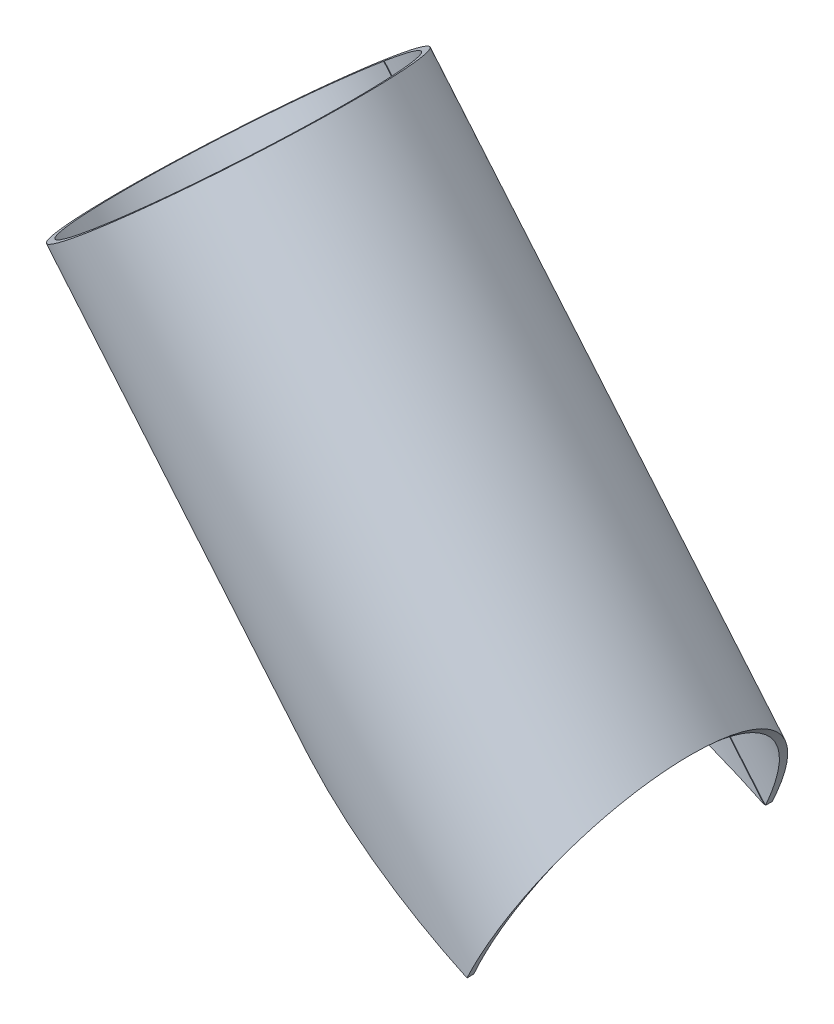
ISO-10303-21;
HEADER;
FILE_DESCRIPTION(('STEP AP214'),'2;1');
FILE_NAME('part.step','',(''),(''),'','','');
FILE_SCHEMA(('AUTOMOTIVE_DESIGN { 1 0 10303 214 1 1 1 1 }'));
ENDSEC;
DATA;
#1=APPLICATION_CONTEXT('core data for automotive mechanical design processes');
#2=APPLICATION_PROTOCOL_DEFINITION('international standard','automotive_design',2000,#1);
#3=PRODUCT_CONTEXT('',#1,'mechanical');
#4=PRODUCT('Part','Part','',(#3));
#5=PRODUCT_RELATED_PRODUCT_CATEGORY('part','',(#4));
#6=PRODUCT_DEFINITION_FORMATION('','',#4);
#7=PRODUCT_DEFINITION_CONTEXT('part definition',#1,'design');
#8=PRODUCT_DEFINITION('design','',#6,#7);
#9=PRODUCT_DEFINITION_SHAPE('','',#8);
#10=(LENGTH_UNIT() NAMED_UNIT(*) SI_UNIT(.MILLI.,.METRE.));
#11=(NAMED_UNIT(*) PLANE_ANGLE_UNIT() SI_UNIT($,.RADIAN.));
#12=(NAMED_UNIT(*) SI_UNIT($,.STERADIAN.) SOLID_ANGLE_UNIT());
#13=UNCERTAINTY_MEASURE_WITH_UNIT(LENGTH_MEASURE(1.E-05),#10,'distance_accuracy_value','');
#14=(GEOMETRIC_REPRESENTATION_CONTEXT(3) GLOBAL_UNCERTAINTY_ASSIGNED_CONTEXT((#13)) GLOBAL_UNIT_ASSIGNED_CONTEXT((#10,
#11,#12)) REPRESENTATION_CONTEXT('',''));
#15=CARTESIAN_POINT('',(0.,0.,0.));
#16=DIRECTION('',(0.,0.,1.));
#17=DIRECTION('',(1.,0.,0.));
#18=AXIS2_PLACEMENT_3D('',#15,#16,#17);
#19=CARTESIAN_POINT('',(-449.951326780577,536.231110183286,0.));
#20=DIRECTION('',(-0.642787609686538,0.766044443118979,0.));
#21=DIRECTION('',(-0.766044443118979,-0.642787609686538,0.));
#22=AXIS2_PLACEMENT_3D('',#19,#20,#21);
#23=PLANE('',#22);
#24=DIRECTION('',(0.00212790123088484,0.00178552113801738,-0.999996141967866));
#25=VECTOR('',#24,1.);
#26=CARTESIAN_POINT('',(-449.585327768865,536.538219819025,-171.999336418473));
#27=LINE('',#26,#25);
#28=CARTESIAN_POINT('',(-449.585327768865,536.538219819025,-171.999336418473));
#29=VERTEX_POINT('',#28);
#30=CARTESIAN_POINT('',(-449.568304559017,536.552503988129,-179.999305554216));
#31=VERTEX_POINT('',#30);
#32=EDGE_CURVE('E13',#29,#31,#27,.T.);
#33=ORIENTED_EDGE('',*,*,#32,.F.);
#34=CARTESIAN_POINT('',(-449.951326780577,536.231110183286,0.));
#35=DIRECTION('',(0.642787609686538,-0.766044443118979,0.));
#36=DIRECTION('',(0.766044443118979,0.642787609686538,0.));
#37=AXIS2_PLACEMENT_3D('',#34,#35,#36);
#38=CIRCLE('',#37,172.);
#39=CARTESIAN_POINT('',(-450.317325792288,535.924000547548,-171.999336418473));
#40=VERTEX_POINT('',#39);
#41=EDGE_CURVE('E85',#29,#40,#38,.T.);
#42=ORIENTED_EDGE('',*,*,#41,.T.);
#43=DIRECTION('',(-0.00212790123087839,-0.00178552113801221,-0.999996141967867));
#44=VECTOR('',#43,1.);
#45=CARTESIAN_POINT('',(-450.317325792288,535.924000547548,-171.999336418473));
#46=LINE('',#45,#44);
#47=CARTESIAN_POINT('',(-450.334349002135,535.909716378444,-179.999305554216));
#48=VERTEX_POINT('',#47);
#49=EDGE_CURVE('E50',#40,#48,#46,.T.);
#50=ORIENTED_EDGE('',*,*,#49,.T.);
#51=CARTESIAN_POINT('',(-449.951326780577,536.231110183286,0.));
#52=DIRECTION('',(-0.642787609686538,0.766044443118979,0.));
#53=DIRECTION('',(-0.766044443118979,-0.642787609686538,0.));
#54=AXIS2_PLACEMENT_3D('',#51,#52,#53);
#55=CIRCLE('',#54,180.);
#56=EDGE_CURVE('E87',#31,#48,#55,.F.);
#57=ORIENTED_EDGE('',*,*,#56,.F.);
#58=EDGE_LOOP('',(#33,#42,#50,#57));
#59=FACE_BOUND('',#58,.T.);
#60=ADVANCED_FACE('F38',(#59),#23,.T.);
#61=CARTESIAN_POINT('',(-225.686278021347,268.219142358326,-171.999336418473));
#62=DIRECTION('',(-0.766041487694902,-0.642785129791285,0.00277777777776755));
#63=DIRECTION('',(-0.642787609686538,0.766044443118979,0.));
#64=AXIS2_PLACEMENT_3D('',#61,#62,#63);
#65=PLANE('',#64);
#66=ORIENTED_EDGE('',*,*,#49,.F.);
#67=DIRECTION('',(-0.642787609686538,0.766044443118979,0.));
#68=VECTOR('',#67,1.);
#69=CARTESIAN_POINT('',(-1.05523025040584,0.514284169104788,-171.999336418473));
#70=LINE('',#69,#68);
#71=CARTESIAN_POINT('',(-1.05523025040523,0.514284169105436,-171.999336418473));
#72=VERTEX_POINT('',#71);
#73=EDGE_CURVE('E95',#72,#40,#70,.T.);
#74=ORIENTED_EDGE('',*,*,#73,.F.);
#75=CARTESIAN_POINT('',(-1.07225346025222,0.500000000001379,-179.999305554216));
#76=CARTESIAN_POINT('',(-1.05523025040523,0.514284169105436,-171.999336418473));
#77=B_SPLINE_CURVE_WITH_KNOTS('',1,(#75,#76),.UNSPECIFIED.,.F.,.F.,(2,2),(0.,1.),.UNSPECIFIED.);
#78=CARTESIAN_POINT('',(-1.07225346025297,0.500000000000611,-179.999305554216));
#79=VERTEX_POINT('',#78);
#80=EDGE_CURVE('E225',#72,#79,#77,.F.);
#81=ORIENTED_EDGE('',*,*,#80,.T.);
#82=DIRECTION('',(-0.642787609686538,0.766044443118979,0.));
#83=VECTOR('',#82,1.);
#84=CARTESIAN_POINT('',(1138.6802715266,-1357.80416632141,-179.999305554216));
#85=LINE('',#84,#83);
#86=EDGE_CURVE('E156',#79,#48,#85,.T.);
#87=ORIENTED_EDGE('',*,*,#86,.T.);
#88=EDGE_LOOP('',(#66,#74,#81,#87));
#89=FACE_BOUND('',#88,.T.);
#90=ADVANCED_FACE('F191',(#89),#65,.F.);
#91=CARTESIAN_POINT('',(-7.00358471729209E-13,-2.47120148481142E-12,180.));
#92=CARTESIAN_POINT('',(-12.233671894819,5.70465224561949,180.));
#93=CARTESIAN_POINT('',(-21.4370872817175,9.9962175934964,179.745390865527));
#94=CARTESIAN_POINT('',(-28.3832262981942,13.2353218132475,179.513110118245));
#95=CARTESIAN_POINT('',(-29.135177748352,13.5859530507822,179.486895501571));
#96=CARTESIAN_POINT('',(-30.6405209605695,14.2878892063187,179.432380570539));
#97=CARTESIAN_POINT('',(-31.38740032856,14.636152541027,179.404296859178));
#98=CARTESIAN_POINT('',(-33.6106566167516,15.6728325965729,179.317705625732));
#99=CARTESIAN_POINT('',(-35.069651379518,16.3531396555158,179.256858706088));
#100=CARTESIAN_POINT('',(-39.3770793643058,18.3616454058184,179.066043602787));
#101=CARTESIAN_POINT('',(-42.1559515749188,19.6574326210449,178.927812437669));
#102=CARTESIAN_POINT('',(-47.5281769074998,22.1625957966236,178.634818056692));
#103=CARTESIAN_POINT('',(-50.1215309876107,23.3719709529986,178.480054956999));
#104=CARTESIAN_POINT('',(-55.1228350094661,25.7042135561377,178.159142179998));
#105=CARTESIAN_POINT('',(-57.5240913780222,26.8239228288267,177.993641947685));
#106=CARTESIAN_POINT('',(-64.6568070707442,30.1498783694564,177.471165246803));
#107=CARTESIAN_POINT('',(-69.250584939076,32.2919342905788,177.092204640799));
#108=CARTESIAN_POINT('',(-75.8990891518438,35.3922419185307,176.489341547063));
#109=CARTESIAN_POINT('',(-78.074902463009,36.4068769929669,176.282642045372));
#110=CARTESIAN_POINT('',(-82.345862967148,38.3985091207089,175.859577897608));
#111=CARTESIAN_POINT('',(-84.4370558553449,39.3736482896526,175.643667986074));
#112=CARTESIAN_POINT('',(-90.6500543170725,42.2707702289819,174.977437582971));
#113=CARTESIAN_POINT('',(-94.6949762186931,44.1568951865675,174.510114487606));
#114=CARTESIAN_POINT('',(-102.590538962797,47.8386722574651,173.536953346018));
#115=CARTESIAN_POINT('',(-106.441181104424,49.6343232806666,173.031115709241));
#116=CARTESIAN_POINT('',(-113.948360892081,53.1350043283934,171.988396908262));
#117=CARTESIAN_POINT('',(-117.625416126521,54.8495895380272,171.448717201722));
#118=CARTESIAN_POINT('',(-124.849896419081,58.2183798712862,170.334236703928));
#119=CARTESIAN_POINT('',(-128.393548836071,59.8708240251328,169.759957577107));
#120=CARTESIAN_POINT('',(-135.343701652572,63.1117906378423,168.5819436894));
#121=CARTESIAN_POINT('',(-138.744913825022,64.6978266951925,167.979209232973));
#122=CARTESIAN_POINT('',(-148.792068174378,69.3828129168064,166.124334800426));
#123=CARTESIAN_POINT('',(-155.279671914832,72.4079788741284,164.825490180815));
#124=CARTESIAN_POINT('',(-167.833676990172,78.262165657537,162.127817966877));
#125=CARTESIAN_POINT('',(-173.907852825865,81.0945860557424,160.727628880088));
#126=CARTESIAN_POINT('',(-185.725917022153,86.6054153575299,157.826480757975));
#127=CARTESIAN_POINT('',(-191.452763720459,89.275940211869,156.329571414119));
#128=CARTESIAN_POINT('',(-202.587135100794,94.4678981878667,153.247901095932));
#129=CARTESIAN_POINT('',(-207.999813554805,96.9918398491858,151.661513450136));
#130=CARTESIAN_POINT('',(-218.51607758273,101.895714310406,148.411300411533));
#131=CARTESIAN_POINT('',(-223.616910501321,104.274254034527,146.748533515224));
#132=CARTESIAN_POINT('',(-238.516643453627,111.222030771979,141.642727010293));
#133=CARTESIAN_POINT('',(-247.879391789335,115.588038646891,138.094066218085));
#134=CARTESIAN_POINT('',(-265.588908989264,123.846036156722,130.739013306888));
#135=CARTESIAN_POINT('',(-273.918701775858,127.730434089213,126.939921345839));
#136=CARTESIAN_POINT('',(-289.646212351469,135.063781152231,119.106492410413));
#137=CARTESIAN_POINT('',(-297.034773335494,138.509763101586,115.076656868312));
#138=CARTESIAN_POINT('',(-317.834628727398,148.209132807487,102.685456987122));
#139=CARTESIAN_POINT('',(-329.880601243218,153.825960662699,94.0222995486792));
#140=CARTESIAN_POINT('',(-345.282019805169,161.007707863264,80.6361546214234));
#141=CARTESIAN_POINT('',(-349.969424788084,163.193126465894,76.1104015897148));
#142=CARTESIAN_POINT('',(-358.482390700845,167.162831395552,66.9432424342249));
#143=CARTESIAN_POINT('',(-362.303102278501,168.944852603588,62.3062628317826));
#144=CARTESIAN_POINT('',(-372.468148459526,173.684591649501,48.2803545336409));
#145=CARTESIAN_POINT('',(-377.541635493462,176.050663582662,38.7423696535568));
#146=CARTESIAN_POINT('',(-384.299138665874,179.201487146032,19.5316960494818));
#147=CARTESIAN_POINT('',(-385.993559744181,179.991755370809,9.84318458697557));
#148=CARTESIAN_POINT('',(-386.028656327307,180.008116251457,-9.53915380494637));
#149=CARTESIAN_POINT('',(-384.368404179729,179.233779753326,-19.2350927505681));
#150=CARTESIAN_POINT('',(-377.675332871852,176.11300841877,-38.4590212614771));
#151=CARTESIAN_POINT('',(-372.631711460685,173.760830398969,-48.0059242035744));
#152=CARTESIAN_POINT('',(-362.509243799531,169.040991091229,-62.0451857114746));
#153=CARTESIAN_POINT('',(-358.701598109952,167.265056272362,-66.6876159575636));
#154=CARTESIAN_POINT('',(-350.214426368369,163.307380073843,-75.865123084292));
#155=CARTESIAN_POINT('',(-345.53945504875,161.127749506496,-80.3961719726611));
#156=CARTESIAN_POINT('',(-330.172596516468,153.962076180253,-93.7996780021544));
#157=CARTESIAN_POINT('',(-318.147501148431,148.355095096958,-102.475194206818));
#158=CARTESIAN_POINT('',(-297.37346920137,138.667686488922,-114.88641083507));
#159=CARTESIAN_POINT('',(-289.992168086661,135.225112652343,-118.923450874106));
#160=CARTESIAN_POINT('',(-274.278229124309,127.89809086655,-126.771137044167));
#161=CARTESIAN_POINT('',(-265.953595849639,124.016093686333,-130.577861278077));
#162=CARTESIAN_POINT('',(-252.678251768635,117.825763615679,-136.105572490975));
#163=CARTESIAN_POINT('',(-248.12879794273,115.704374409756,-137.914595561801));
#164=CARTESIAN_POINT('',(-238.754329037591,111.332924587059,-141.466937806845));
#165=CARTESIAN_POINT('',(-233.928162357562,109.082415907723,-143.210576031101));
#166=CARTESIAN_POINT('',(-223.99787706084,104.451904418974,-146.622177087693));
#167=CARTESIAN_POINT('',(-218.898159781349,102.073879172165,-148.288854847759));
#168=CARTESIAN_POINT('',(-208.383152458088,97.1705899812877,-151.547083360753));
#169=CARTESIAN_POINT('',(-202.971114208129,94.6469501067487,-153.137415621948));
#170=CARTESIAN_POINT('',(-191.838055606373,89.4556067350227,-156.226866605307));
#171=CARTESIAN_POINT('',(-186.110131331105,86.784569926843,-157.728088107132));
#172=CARTESIAN_POINT('',(-174.288370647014,81.2720036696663,-160.63802775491));
#173=CARTESIAN_POINT('',(-168.211893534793,78.4385269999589,-162.042651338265));
#174=CARTESIAN_POINT('',(-155.646923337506,72.5792536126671,-164.75024525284));
#175=CARTESIAN_POINT('',(-149.152901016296,69.5510869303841,-166.054065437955));
#176=CARTESIAN_POINT('',(-139.094693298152,64.8609315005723,-167.916322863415));
#177=CARTESIAN_POINT('',(-135.687826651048,63.2722537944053,-168.52181335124));
#178=CARTESIAN_POINT('',(-128.727362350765,60.0264810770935,-169.705010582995));
#179=CARTESIAN_POINT('',(-125.178821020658,58.3717614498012,-170.281765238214));
#180=CARTESIAN_POINT('',(-117.945104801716,54.9986684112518,-171.400984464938));
#181=CARTESIAN_POINT('',(-114.265779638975,53.2830230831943,-171.942640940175));
#182=CARTESIAN_POINT('',(-106.744426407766,49.7757202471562,-172.990530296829));
#183=CARTESIAN_POINT('',(-102.88747939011,47.9771337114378,-173.498756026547));
#184=CARTESIAN_POINT('',(-94.9808869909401,44.290222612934,-174.476359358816));
#185=CARTESIAN_POINT('',(-90.931240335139,42.4018991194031,-174.945736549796));
#186=CARTESIAN_POINT('',(-84.7123510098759,39.5020227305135,-175.614848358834));
#187=CARTESIAN_POINT('',(-82.6170220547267,38.5249467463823,-175.831934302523));
#188=CARTESIAN_POINT('',(-78.3369200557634,36.5290480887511,-176.257376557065));
#189=CARTESIAN_POINT('',(-76.157178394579,35.5125836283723,-176.465173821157));
#190=CARTESIAN_POINT('',(-69.498823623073,32.4076933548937,-177.071098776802));
#191=CARTESIAN_POINT('',(-64.9010583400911,30.2637894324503,-177.451790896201));
#192=CARTESIAN_POINT('',(-57.7662558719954,26.9368516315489,-177.976590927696));
#193=CARTESIAN_POINT('',(-55.3602588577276,25.8149158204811,-178.143157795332));
#194=CARTESIAN_POINT('',(-50.3433583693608,23.4753928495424,-178.466502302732));
#195=CARTESIAN_POINT('',(-47.7453745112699,22.2638666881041,-178.622227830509));
#196=CARTESIAN_POINT('',(-42.3702432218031,19.7573658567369,-178.916811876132));
#197=CARTESIAN_POINT('',(-39.5930948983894,18.4623919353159,-179.055670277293));
#198=CARTESIAN_POINT('',(-35.2930277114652,16.4573211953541,-179.247322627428));
#199=CARTESIAN_POINT('',(-33.8372823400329,15.7785283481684,-179.308431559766));
#200=CARTESIAN_POINT('',(-31.6200946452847,14.744672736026,-179.395410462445));
#201=CARTESIAN_POINT('',(-30.875437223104,14.3974430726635,-179.4236225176));
#202=CARTESIAN_POINT('',(-29.3749361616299,13.6977585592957,-179.478395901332));
#203=CARTESIAN_POINT('',(-28.6295075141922,13.3501660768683,-179.504625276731));
#204=CARTESIAN_POINT('',(-21.5013123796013,10.0259998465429,-179.744948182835));
#205=CARTESIAN_POINT('',(-12.5797637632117,5.86603481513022,-179.984399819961));
#206=CARTESIAN_POINT('',(-1.07225346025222,0.500000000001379,-179.999305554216));
#207=CARTESIAN_POINT('',(-6.28064879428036E-13,-2.40923554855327E-12,172.));
#208=CARTESIAN_POINT('',(-12.0394173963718,5.86760951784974,172.));
#209=CARTESIAN_POINT('',(-21.0967484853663,10.28179575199,171.756706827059));
#210=CARTESIAN_POINT('',(-27.9326113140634,13.6134326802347,171.534749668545));
#211=CARTESIAN_POINT('',(-28.672624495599,13.9740813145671,171.509700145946));
#212=CARTESIAN_POINT('',(-30.1540683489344,14.6960714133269,171.457608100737));
#213=CARTESIAN_POINT('',(-30.8890899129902,15.0542846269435,171.430772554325));
#214=CARTESIAN_POINT('',(-33.0770486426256,16.1205828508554,171.348029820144));
#215=CARTESIAN_POINT('',(-34.5128795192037,16.8203267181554,171.28988720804));
#216=CARTESIAN_POINT('',(-38.7519205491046,18.8862159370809,171.107552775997));
#217=CARTESIAN_POINT('',(-41.4866746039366,20.2190226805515,170.975465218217));
#218=CARTESIAN_POINT('',(-46.7736110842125,22.795751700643,170.695492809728));
#219=CARTESIAN_POINT('',(-49.3257944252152,24.039673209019,170.547608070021));
#220=CARTESIAN_POINT('',(-54.2476993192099,26.4385395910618,170.240958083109));
#221=CARTESIAN_POINT('',(-56.6108327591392,27.5902377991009,170.082813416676));
#222=CARTESIAN_POINT('',(-63.6303068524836,31.0112143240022,169.583557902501));
#223=CARTESIAN_POINT('',(-68.1511521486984,33.2144679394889,169.221439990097));
#224=CARTESIAN_POINT('',(-74.6941052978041,36.4033434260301,168.645370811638));
#225=CARTESIAN_POINT('',(-76.8353759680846,37.4469632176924,168.447857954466));
#226=CARTESIAN_POINT('',(-81.0385313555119,39.495490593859,168.043596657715));
#227=CARTESIAN_POINT('',(-83.0965242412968,40.4984878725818,167.837282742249));
#228=CARTESIAN_POINT('',(-89.2108834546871,43.4783779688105,167.200662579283));
#229=CARTESIAN_POINT('',(-93.1915865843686,45.418388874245,166.754109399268));
#230=CARTESIAN_POINT('',(-100.961798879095,49.2053474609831,165.824199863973));
#231=CARTESIAN_POINT('',(-104.751309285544,51.0522941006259,165.340843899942));
#232=CARTESIAN_POINT('',(-112.139304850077,54.6529825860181,164.344468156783));
#233=CARTESIAN_POINT('',(-115.757981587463,56.4165531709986,163.828774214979));
#234=CARTESIAN_POINT('',(-122.867764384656,59.8815861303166,162.763826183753));
#235=CARTESIAN_POINT('',(-126.355157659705,61.5812373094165,162.21507057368));
#236=CARTESIAN_POINT('',(-133.194970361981,64.9147902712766,161.08941285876));
#237=CARTESIAN_POINT('',(-136.542185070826,66.5461355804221,160.513466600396));
#238=CARTESIAN_POINT('',(-146.429828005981,71.3649677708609,158.741031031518));
#239=CARTESIAN_POINT('',(-152.81443269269,74.4765601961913,157.499912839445));
#240=CARTESIAN_POINT('',(-165.169132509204,80.4979839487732,154.922137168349));
#241=CARTESIAN_POINT('',(-171.146873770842,83.4113225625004,153.58417870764));
#242=CARTESIAN_POINT('',(-182.77731258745,89.0795882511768,150.811970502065));
#243=CARTESIAN_POINT('',(-188.413240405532,91.8264031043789,149.38159046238));
#244=CARTESIAN_POINT('',(-199.370839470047,97.1666906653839,146.436883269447));
#245=CARTESIAN_POINT('',(-204.697584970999,99.7627386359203,144.921001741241));
#246=CARTESIAN_POINT('',(-215.046892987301,104.806705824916,141.815242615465));
#247=CARTESIAN_POINT('',(-220.066744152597,107.25319730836,140.226376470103));
#248=CARTESIAN_POINT('',(-234.729925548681,114.399464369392,135.347494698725));
#249=CARTESIAN_POINT('',(-243.944031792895,118.890197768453,131.956552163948));
#250=CARTESIAN_POINT('',(-261.372388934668,127.384116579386,124.928390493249));
#251=CARTESIAN_POINT('',(-269.569940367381,131.379478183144,121.298147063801));
#252=CARTESIAN_POINT('',(-285.047748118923,138.922350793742,113.812870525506));
#253=CARTESIAN_POINT('',(-292.319021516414,142.466748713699,109.962138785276));
#254=CARTESIAN_POINT('',(-312.788661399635,152.443202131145,98.1216588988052));
#255=CARTESIAN_POINT('',(-324.643384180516,158.220507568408,89.843530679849));
#256=CARTESIAN_POINT('',(-339.800287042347,165.607427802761,77.0523255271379));
#257=CARTESIAN_POINT('',(-344.413266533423,167.855296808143,72.7277170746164));
#258=CARTESIAN_POINT('',(-352.791080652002,171.938407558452,63.967987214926));
#259=CARTESIAN_POINT('',(-356.551142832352,173.771319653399,59.5370955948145));
#260=CARTESIAN_POINT('',(-366.554801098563,178.646479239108,46.1345609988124));
#261=CARTESIAN_POINT('',(-371.547746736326,181.080133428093,37.0204865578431));
#262=CARTESIAN_POINT('',(-378.197961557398,184.320982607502,18.6636206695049));
#263=CARTESIAN_POINT('',(-379.865485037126,185.133820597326,9.40570971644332));
#264=CARTESIAN_POINT('',(-379.900024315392,185.150649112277,-9.11519141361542));
#265=CARTESIAN_POINT('',(-378.266127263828,184.354198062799,-18.3801997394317));
#266=CARTESIAN_POINT('',(-371.679321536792,181.144259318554,-36.7497314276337));
#267=CARTESIAN_POINT('',(-366.715766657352,178.724897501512,-45.8723275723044));
#268=CARTESIAN_POINT('',(-356.75401191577,173.870204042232,-59.2876219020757));
#269=CARTESIAN_POINT('',(-353.006808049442,172.043552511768,-63.7237219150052));
#270=CARTESIAN_POINT('',(-344.654378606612,167.972814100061,-72.4933398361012));
#271=CARTESIAN_POINT('',(-340.053635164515,165.730898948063,-76.8230087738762));
#272=CARTESIAN_POINT('',(-324.930742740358,158.360513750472,-89.6308034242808));
#273=CARTESIAN_POINT('',(-313.096568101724,152.593331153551,-97.9207411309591));
#274=CARTESIAN_POINT('',(-292.652339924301,142.629184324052,-109.780348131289));
#275=CARTESIAN_POINT('',(-285.388211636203,139.088290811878,-113.63796416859));
#276=CARTESIAN_POINT('',(-269.923759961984,131.55192433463,-121.136864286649));
#277=CARTESIAN_POINT('',(-261.731286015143,127.559032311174,-124.774400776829));
#278=CARTESIAN_POINT('',(-248.666704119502,121.191851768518,-130.05643593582));
#279=CARTESIAN_POINT('',(-244.189479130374,119.009855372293,-131.785057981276));
#280=CARTESIAN_POINT('',(-234.963838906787,114.513523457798,-135.179518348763));
#281=CARTESIAN_POINT('',(-230.214292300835,112.198722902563,-136.84566154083));
#282=CARTESIAN_POINT('',(-220.441662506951,107.43592273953,-140.105635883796));
#283=CARTESIAN_POINT('',(-215.422909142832,104.989960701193,-141.698239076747));
#284=CARTESIAN_POINT('',(-205.074837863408,99.9465955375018,-144.811657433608));
#285=CARTESIAN_POINT('',(-199.748722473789,97.3508578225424,-146.331308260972));
#286=CARTESIAN_POINT('',(-188.792415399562,92.011202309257,-149.283450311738));
#287=CARTESIAN_POINT('',(-183.155426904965,89.2638613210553,-150.717950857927));
#288=CARTESIAN_POINT('',(-171.52134999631,83.593809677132,-153.498559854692));
#289=CARTESIAN_POINT('',(-165.541344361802,80.6793838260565,-154.840755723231));
#290=CARTESIAN_POINT('',(-153.175854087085,74.6527269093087,-157.428012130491));
#291=CARTESIAN_POINT('',(-146.784932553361,71.5380483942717,-158.673884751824));
#292=CARTESIAN_POINT('',(-136.886411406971,66.713900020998,-160.453375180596));
#293=CARTESIAN_POINT('',(-133.533631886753,65.0798378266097,-161.031954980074));
#294=CARTESIAN_POINT('',(-126.683671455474,61.7413413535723,-162.162565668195));
#295=CARTESIAN_POINT('',(-123.191466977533,60.0393494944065,-162.713686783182));
#296=CARTESIAN_POINT('',(-116.072594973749,56.5698907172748,-163.783162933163));
#297=CARTESIAN_POINT('',(-112.451684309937,54.8052298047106,-164.300745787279));
#298=CARTESIAN_POINT('',(-105.049740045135,51.1977309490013,-165.302062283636));
#299=CARTESIAN_POINT('',(-101.254024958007,49.3477647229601,-165.787700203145));
#300=CARTESIAN_POINT('',(-93.4729583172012,45.55552500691,-166.721854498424));
#301=CARTESIAN_POINT('',(-89.4876055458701,43.6132525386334,-167.170370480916));
#302=CARTESIAN_POINT('',(-83.3674488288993,40.6305296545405,-167.80974398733));
#303=CARTESIAN_POINT('',(-81.3053853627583,39.6255406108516,-168.017181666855));
#304=CARTESIAN_POINT('',(-77.0932335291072,37.5726249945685,-168.423715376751));
#305=CARTESIAN_POINT('',(-74.9480969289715,36.5271234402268,-168.622277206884));
#306=CARTESIAN_POINT('',(-68.3954498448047,33.3335338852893,-169.201272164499));
#307=CARTESIAN_POINT('',(-63.8706806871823,31.1283789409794,-169.565044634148));
#308=CARTESIAN_POINT('',(-56.8491527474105,27.7063925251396,-170.066520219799));
#309=CARTESIAN_POINT('',(-54.4813535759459,26.5524049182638,-170.225684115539));
#310=CARTESIAN_POINT('',(-49.5440996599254,24.1460505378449,-170.534657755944));
#311=CARTESIAN_POINT('',(-46.9873602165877,22.8999162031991,-170.683462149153));
#312=CARTESIAN_POINT('',(-41.6975642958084,20.3218104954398,-170.964953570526));
#313=CARTESIAN_POINT('',(-38.9645069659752,18.9898398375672,-171.097640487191));
#314=CARTESIAN_POINT('',(-34.7327099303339,16.9274836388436,-171.280774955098));
#315=CARTESIAN_POINT('',(-33.3000768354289,16.229297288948,-171.339167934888));
#316=CARTESIAN_POINT('',(-31.1180902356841,15.1659044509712,-171.422281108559));
#317=CARTESIAN_POINT('',(-30.3852552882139,14.8087545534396,-171.449239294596));
#318=CARTESIAN_POINT('',(-28.9085765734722,14.0890807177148,-171.501578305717));
#319=CARTESIAN_POINT('',(-28.1749825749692,13.7315577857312,-171.526641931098));
#320=CARTESIAN_POINT('',(-21.1599502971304,10.3124366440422,-171.756283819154));
#321=CARTESIAN_POINT('',(-12.3800202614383,6.03360539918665,-171.985093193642));
#322=CARTESIAN_POINT('',(-1.05523025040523,0.514284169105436,-171.999336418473));
#323=B_SPLINE_SURFACE_WITH_KNOTS('',1,3,((#91,#92,#93,#94,#95,#96,#97,#98,#99,#100,#101,#102,
#103,#104,#105,#106,#107,#108,#109,#110,#111,#112,#113,#114,#115,#116,#117,#118,#119,#120,#121,
#122,#123,#124,#125,#126,#127,#128,#129,#130,#131,#132,#133,#134,#135,#136,#137,#138,#139,#140,
#141,#142,#143,#144,#145,#146,#147,#148,#149,#150,#151,#152,#153,#154,#155,#156,#157,#158,#159,
#160,#161,#162,#163,#164,#165,#166,#167,#168,#169,#170,#171,#172,#173,#174,#175,#176,#177,#178,
#179,#180,#181,#182,#183,#184,#185,#186,#187,#188,#189,#190,#191,#192,#193,#194,#195,#196,#197,
#198,#199,#200,#201,#202,#203,#204,#205,#206),(#207,#208,#209,#210,#211,#212,#213,#214,#215,
#216,#217,#218,#219,#220,#221,#222,#223,#224,#225,#226,#227,#228,#229,#230,#231,#232,#233,#234,
#235,#236,#237,#238,#239,#240,#241,#242,#243,#244,#245,#246,#247,#248,#249,#250,#251,#252,#253,
#254,#255,#256,#257,#258,#259,#260,#261,#262,#263,#264,#265,#266,#267,#268,#269,#270,#271,#272,
#273,#274,#275,#276,#277,#278,#279,#280,#281,#282,#283,#284,#285,#286,#287,#288,#289,#290,#291,
#292,#293,#294,#295,#296,#297,#298,#299,#300,#301,#302,#303,#304,#305,#306,#307,#308,#309,#310,
#311,#312,#313,#314,#315,#316,#317,#318,#319,#320,#321,#322)),.UNSPECIFIED.,.F.,.F.,.F.,(2,2),
(4,2,2,2,2,2,2,2,2,2,2,2,2,2,2,2,2,2,2,2,2,2,2,2,2,2,2,2,2,2,2,2,2,2,2,2,2,2,2,2,2,2,2,2,2,2,2,
2,2,2,2,2,2,2,2,2,2,4),(0.,1.),(0.,0.0078125,0.0087890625,0.009765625,0.01171875,0.015625,
0.01953125,0.0234375,0.03125,0.03515625,0.0390625,0.046875,0.0546875,0.0625,0.0703125,0.078125,
0.09375,0.109375,0.125,0.140625,0.15625,0.1875,0.21875,0.25,0.3125,0.34375,0.375,0.4375,0.5,
0.5625,0.625,0.65625,0.6875,0.75,0.78125,0.8125,0.828125,0.84375,0.859375,0.875,0.890625,
0.90625,0.921875,0.9296875,0.9375,0.9453125,0.953125,0.9609375,0.96484375,0.96875,0.9765625,
0.98046875,0.984375,0.98828125,0.990234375,0.9912109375,0.9921875,1.),.UNSPECIFIED.);
#324=CARTESIAN_POINT('',(-1.05523025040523,0.514284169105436,-171.999336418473));
#325=CARTESIAN_POINT('',(-12.3800202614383,6.03360539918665,-171.985093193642));
#326=CARTESIAN_POINT('',(-21.1599502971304,10.3124366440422,-171.756283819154));
#327=CARTESIAN_POINT('',(-28.1749825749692,13.7315577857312,-171.526641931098));
#328=CARTESIAN_POINT('',(-28.9085765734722,14.0890807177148,-171.501578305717));
#329=CARTESIAN_POINT('',(-30.3852552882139,14.8087545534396,-171.449239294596));
#330=CARTESIAN_POINT('',(-31.1180902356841,15.1659044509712,-171.422281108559));
#331=CARTESIAN_POINT('',(-33.3000768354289,16.229297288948,-171.339167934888));
#332=CARTESIAN_POINT('',(-34.7327099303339,16.9274836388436,-171.280774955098));
#333=CARTESIAN_POINT('',(-38.9645069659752,18.9898398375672,-171.097640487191));
#334=CARTESIAN_POINT('',(-41.6975642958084,20.3218104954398,-170.964953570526));
#335=CARTESIAN_POINT('',(-46.9873602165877,22.8999162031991,-170.683462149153));
#336=CARTESIAN_POINT('',(-49.5440996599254,24.1460505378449,-170.534657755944));
#337=CARTESIAN_POINT('',(-54.4813535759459,26.5524049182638,-170.225684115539));
#338=CARTESIAN_POINT('',(-56.8491527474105,27.7063925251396,-170.066520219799));
#339=CARTESIAN_POINT('',(-63.8706806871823,31.1283789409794,-169.565044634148));
#340=CARTESIAN_POINT('',(-68.3954498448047,33.3335338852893,-169.201272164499));
#341=CARTESIAN_POINT('',(-74.9480969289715,36.5271234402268,-168.622277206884));
#342=CARTESIAN_POINT('',(-77.0932335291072,37.5726249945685,-168.423715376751));
#343=CARTESIAN_POINT('',(-81.3053853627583,39.6255406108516,-168.017181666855));
#344=CARTESIAN_POINT('',(-83.3674488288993,40.6305296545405,-167.80974398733));
#345=CARTESIAN_POINT('',(-89.4876055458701,43.6132525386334,-167.170370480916));
#346=CARTESIAN_POINT('',(-93.4729583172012,45.55552500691,-166.721854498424));
#347=CARTESIAN_POINT('',(-101.254024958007,49.3477647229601,-165.787700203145));
#348=CARTESIAN_POINT('',(-105.049740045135,51.1977309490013,-165.302062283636));
#349=CARTESIAN_POINT('',(-112.451684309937,54.8052298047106,-164.300745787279));
#350=CARTESIAN_POINT('',(-116.072594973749,56.5698907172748,-163.783162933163));
#351=CARTESIAN_POINT('',(-123.191466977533,60.0393494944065,-162.713686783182));
#352=CARTESIAN_POINT('',(-126.683671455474,61.7413413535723,-162.162565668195));
#353=CARTESIAN_POINT('',(-133.533631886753,65.0798378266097,-161.031954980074));
#354=CARTESIAN_POINT('',(-136.886411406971,66.713900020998,-160.453375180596));
#355=CARTESIAN_POINT('',(-146.784932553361,71.5380483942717,-158.673884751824));
#356=CARTESIAN_POINT('',(-153.175854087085,74.6527269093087,-157.428012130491));
#357=CARTESIAN_POINT('',(-165.541344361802,80.6793838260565,-154.840755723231));
#358=CARTESIAN_POINT('',(-171.52134999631,83.593809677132,-153.498559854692));
#359=CARTESIAN_POINT('',(-183.155426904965,89.2638613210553,-150.717950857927));
#360=CARTESIAN_POINT('',(-188.792415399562,92.011202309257,-149.283450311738));
#361=CARTESIAN_POINT('',(-199.748722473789,97.3508578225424,-146.331308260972));
#362=CARTESIAN_POINT('',(-205.074837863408,99.9465955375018,-144.811657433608));
#363=CARTESIAN_POINT('',(-215.422909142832,104.989960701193,-141.698239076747));
#364=CARTESIAN_POINT('',(-220.441662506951,107.43592273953,-140.105635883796));
#365=CARTESIAN_POINT('',(-230.214292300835,112.198722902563,-136.84566154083));
#366=CARTESIAN_POINT('',(-234.963838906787,114.513523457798,-135.179518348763));
#367=CARTESIAN_POINT('',(-244.189479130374,119.009855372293,-131.785057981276));
#368=CARTESIAN_POINT('',(-248.666704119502,121.191851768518,-130.05643593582));
#369=CARTESIAN_POINT('',(-261.731286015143,127.559032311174,-124.774400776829));
#370=CARTESIAN_POINT('',(-269.923759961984,131.55192433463,-121.136864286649));
#371=CARTESIAN_POINT('',(-285.388211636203,139.088290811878,-113.63796416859));
#372=CARTESIAN_POINT('',(-292.652339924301,142.629184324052,-109.780348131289));
#373=CARTESIAN_POINT('',(-313.096568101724,152.593331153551,-97.9207411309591));
#374=CARTESIAN_POINT('',(-324.930742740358,158.360513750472,-89.6308034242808));
#375=CARTESIAN_POINT('',(-340.053635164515,165.730898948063,-76.8230087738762));
#376=CARTESIAN_POINT('',(-344.654378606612,167.972814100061,-72.4933398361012));
#377=CARTESIAN_POINT('',(-353.006808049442,172.043552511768,-63.7237219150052));
#378=CARTESIAN_POINT('',(-356.75401191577,173.870204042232,-59.2876219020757));
#379=CARTESIAN_POINT('',(-366.715766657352,178.724897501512,-45.8723275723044));
#380=CARTESIAN_POINT('',(-371.679321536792,181.144259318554,-36.7497314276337));
#381=CARTESIAN_POINT('',(-378.266127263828,184.354198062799,-18.3801997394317));
#382=CARTESIAN_POINT('',(-379.900024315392,185.150649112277,-9.11519141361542));
#383=CARTESIAN_POINT('',(-379.865485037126,185.133820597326,9.40570971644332));
#384=CARTESIAN_POINT('',(-378.197961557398,184.320982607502,18.6636206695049));
#385=CARTESIAN_POINT('',(-371.547746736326,181.080133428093,37.0204865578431));
#386=CARTESIAN_POINT('',(-366.554801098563,178.646479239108,46.1345609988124));
#387=CARTESIAN_POINT('',(-356.551142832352,173.771319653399,59.5370955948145));
#388=CARTESIAN_POINT('',(-352.791080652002,171.938407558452,63.967987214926));
#389=CARTESIAN_POINT('',(-344.413266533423,167.855296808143,72.7277170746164));
#390=CARTESIAN_POINT('',(-339.800287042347,165.607427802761,77.0523255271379));
#391=CARTESIAN_POINT('',(-324.643384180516,158.220507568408,89.843530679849));
#392=CARTESIAN_POINT('',(-312.788661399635,152.443202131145,98.1216588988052));
#393=CARTESIAN_POINT('',(-292.319021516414,142.466748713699,109.962138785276));
#394=CARTESIAN_POINT('',(-285.047748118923,138.922350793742,113.812870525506));
#395=CARTESIAN_POINT('',(-269.569940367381,131.379478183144,121.298147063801));
#396=CARTESIAN_POINT('',(-261.372388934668,127.384116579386,124.928390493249));
#397=CARTESIAN_POINT('',(-243.944031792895,118.890197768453,131.956552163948));
#398=CARTESIAN_POINT('',(-234.729925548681,114.399464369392,135.347494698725));
#399=CARTESIAN_POINT('',(-220.066744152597,107.25319730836,140.226376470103));
#400=CARTESIAN_POINT('',(-215.046892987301,104.806705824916,141.815242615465));
#401=CARTESIAN_POINT('',(-204.697584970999,99.7627386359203,144.921001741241));
#402=CARTESIAN_POINT('',(-199.370839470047,97.1666906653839,146.436883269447));
#403=CARTESIAN_POINT('',(-188.413240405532,91.8264031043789,149.38159046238));
#404=CARTESIAN_POINT('',(-182.77731258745,89.0795882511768,150.811970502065));
#405=CARTESIAN_POINT('',(-171.146873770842,83.4113225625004,153.58417870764));
#406=CARTESIAN_POINT('',(-165.169132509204,80.4979839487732,154.922137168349));
#407=CARTESIAN_POINT('',(-152.81443269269,74.4765601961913,157.499912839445));
#408=CARTESIAN_POINT('',(-146.429828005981,71.3649677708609,158.741031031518));
#409=CARTESIAN_POINT('',(-136.542185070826,66.5461355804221,160.513466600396));
#410=CARTESIAN_POINT('',(-133.194970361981,64.9147902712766,161.08941285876));
#411=CARTESIAN_POINT('',(-126.355157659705,61.5812373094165,162.21507057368));
#412=CARTESIAN_POINT('',(-122.867764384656,59.8815861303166,162.763826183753));
#413=CARTESIAN_POINT('',(-115.757981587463,56.4165531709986,163.828774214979));
#414=CARTESIAN_POINT('',(-112.139304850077,54.6529825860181,164.344468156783));
#415=CARTESIAN_POINT('',(-104.751309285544,51.0522941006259,165.340843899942));
#416=CARTESIAN_POINT('',(-100.961798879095,49.2053474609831,165.824199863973));
#417=CARTESIAN_POINT('',(-93.1915865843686,45.418388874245,166.754109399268));
#418=CARTESIAN_POINT('',(-89.2108834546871,43.4783779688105,167.200662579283));
#419=CARTESIAN_POINT('',(-83.0965242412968,40.4984878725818,167.837282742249));
#420=CARTESIAN_POINT('',(-81.0385313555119,39.495490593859,168.043596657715));
#421=CARTESIAN_POINT('',(-76.8353759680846,37.4469632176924,168.447857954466));
#422=CARTESIAN_POINT('',(-74.6941052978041,36.4033434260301,168.645370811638));
#423=CARTESIAN_POINT('',(-68.1511521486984,33.2144679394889,169.221439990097));
#424=CARTESIAN_POINT('',(-63.6303068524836,31.0112143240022,169.583557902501));
#425=CARTESIAN_POINT('',(-56.6108327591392,27.5902377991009,170.082813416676));
#426=CARTESIAN_POINT('',(-54.2476993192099,26.4385395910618,170.240958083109));
#427=CARTESIAN_POINT('',(-49.3257944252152,24.039673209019,170.547608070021));
#428=CARTESIAN_POINT('',(-46.7736110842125,22.795751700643,170.695492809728));
#429=CARTESIAN_POINT('',(-41.4866746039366,20.2190226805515,170.975465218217));
#430=CARTESIAN_POINT('',(-38.7519205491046,18.8862159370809,171.107552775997));
#431=CARTESIAN_POINT('',(-34.5128795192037,16.8203267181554,171.28988720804));
#432=CARTESIAN_POINT('',(-33.0770486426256,16.1205828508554,171.348029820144));
#433=CARTESIAN_POINT('',(-30.8890899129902,15.0542846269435,171.430772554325));
#434=CARTESIAN_POINT('',(-30.1540683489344,14.6960714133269,171.457608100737));
#435=CARTESIAN_POINT('',(-28.672624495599,13.9740813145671,171.509700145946));
#436=CARTESIAN_POINT('',(-27.9326113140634,13.6134326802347,171.534749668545));
#437=CARTESIAN_POINT('',(-21.0967484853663,10.28179575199,171.756706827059));
#438=CARTESIAN_POINT('',(-12.0394173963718,5.86760951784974,172.));
#439=CARTESIAN_POINT('',(-6.28064879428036E-13,-2.40923554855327E-12,172.));
#440=B_SPLINE_CURVE_WITH_KNOTS('',3,(#324,#325,#326,#327,#328,#329,#330,#331,#332,#333,#334,
#335,#336,#337,#338,#339,#340,#341,#342,#343,#344,#345,#346,#347,#348,#349,#350,#351,#352,#353,
#354,#355,#356,#357,#358,#359,#360,#361,#362,#363,#364,#365,#366,#367,#368,#369,#370,#371,#372,
#373,#374,#375,#376,#377,#378,#379,#380,#381,#382,#383,#384,#385,#386,#387,#388,#389,#390,#391,
#392,#393,#394,#395,#396,#397,#398,#399,#400,#401,#402,#403,#404,#405,#406,#407,#408,#409,#410,
#411,#412,#413,#414,#415,#416,#417,#418,#419,#420,#421,#422,#423,#424,#425,#426,#427,#428,#429,
#430,#431,#432,#433,#434,#435,#436,#437,#438,#439),.UNSPECIFIED.,.F.,.F.,(4,2,2,2,2,2,2,2,2,2,2,
2,2,2,2,2,2,2,2,2,2,2,2,2,2,2,2,2,2,2,2,2,2,2,2,2,2,2,2,2,2,2,2,2,2,2,2,2,2,2,2,2,2,2,2,2,2,4),
(0.,0.0078125,0.0087890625,0.009765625,0.01171875,0.015625,0.01953125,0.0234375,0.03125,
0.03515625,0.0390625,0.046875,0.0546875,0.0625,0.0703125,0.078125,0.09375,0.109375,0.125,
0.140625,0.15625,0.171875,0.1875,0.21875,0.25,0.3125,0.34375,0.375,0.4375,0.5,0.5625,0.625,
0.65625,0.6875,0.75,0.78125,0.8125,0.84375,0.859375,0.875,0.890625,0.90625,0.921875,0.9296875,
0.9375,0.9453125,0.953125,0.9609375,0.96484375,0.96875,0.9765625,0.98046875,0.984375,0.98828125,
0.990234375,0.9912109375,0.9921875,1.),.UNSPECIFIED.);
#441=CARTESIAN_POINT('',(-6.28064879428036E-13,-2.40923554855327E-12,172.));
#442=VERTEX_POINT('',#441);
#443=EDGE_CURVE('E169',#442,#72,#440,.F.);
#444=CARTESIAN_POINT('',(-6.28064879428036E-13,-2.40923554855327E-12,172.));
#445=CARTESIAN_POINT('',(-7.00358471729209E-13,-2.47120148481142E-12,180.));
#446=B_SPLINE_CURVE_WITH_KNOTS('',1,(#444,#445),.UNSPECIFIED.,.F.,.F.,(2,2),(0.,1.),.UNSPECIFIED.);
#447=CARTESIAN_POINT('',(-4.12141893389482E-07,1.92181947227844E-07,180.));
#448=VERTEX_POINT('',#447);
#449=EDGE_CURVE('E155',#442,#448,#446,.T.);
#450=CARTESIAN_POINT('',(-7.00358471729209E-13,-2.47120148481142E-12,180.));
#451=CARTESIAN_POINT('',(-12.233671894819,5.70465224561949,180.));
#452=CARTESIAN_POINT('',(-21.4370872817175,9.9962175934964,179.745390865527));
#453=CARTESIAN_POINT('',(-28.3832262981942,13.2353218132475,179.513110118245));
#454=CARTESIAN_POINT('',(-29.135177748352,13.5859530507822,179.486895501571));
#455=CARTESIAN_POINT('',(-30.6405209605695,14.2878892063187,179.432380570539));
#456=CARTESIAN_POINT('',(-31.38740032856,14.636152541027,179.404296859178));
#457=CARTESIAN_POINT('',(-33.6106566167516,15.6728325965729,179.317705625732));
#458=CARTESIAN_POINT('',(-35.069651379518,16.3531396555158,179.256858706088));
#459=CARTESIAN_POINT('',(-39.3770793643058,18.3616454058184,179.066043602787));
#460=CARTESIAN_POINT('',(-42.1559515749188,19.6574326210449,178.927812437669));
#461=CARTESIAN_POINT('',(-47.5281769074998,22.1625957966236,178.634818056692));
#462=CARTESIAN_POINT('',(-50.1215309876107,23.3719709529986,178.480054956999));
#463=CARTESIAN_POINT('',(-55.1228350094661,25.7042135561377,178.159142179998));
#464=CARTESIAN_POINT('',(-57.5240913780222,26.8239228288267,177.993641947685));
#465=CARTESIAN_POINT('',(-64.6568070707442,30.1498783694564,177.471165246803));
#466=CARTESIAN_POINT('',(-69.250584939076,32.2919342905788,177.092204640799));
#467=CARTESIAN_POINT('',(-75.8990891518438,35.3922419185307,176.489341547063));
#468=CARTESIAN_POINT('',(-78.074902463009,36.4068769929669,176.282642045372));
#469=CARTESIAN_POINT('',(-82.345862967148,38.3985091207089,175.859577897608));
#470=CARTESIAN_POINT('',(-84.4370558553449,39.3736482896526,175.643667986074));
#471=CARTESIAN_POINT('',(-90.6500543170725,42.2707702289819,174.977437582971));
#472=CARTESIAN_POINT('',(-94.6949762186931,44.1568951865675,174.510114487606));
#473=CARTESIAN_POINT('',(-102.590538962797,47.8386722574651,173.536953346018));
#474=CARTESIAN_POINT('',(-106.441181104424,49.6343232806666,173.031115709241));
#475=CARTESIAN_POINT('',(-113.948360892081,53.1350043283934,171.988396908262));
#476=CARTESIAN_POINT('',(-117.625416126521,54.8495895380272,171.448717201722));
#477=CARTESIAN_POINT('',(-124.849896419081,58.2183798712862,170.334236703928));
#478=CARTESIAN_POINT('',(-128.393548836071,59.8708240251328,169.759957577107));
#479=CARTESIAN_POINT('',(-135.343701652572,63.1117906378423,168.5819436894));
#480=CARTESIAN_POINT('',(-138.744913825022,64.6978266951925,167.979209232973));
#481=CARTESIAN_POINT('',(-148.792068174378,69.3828129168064,166.124334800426));
#482=CARTESIAN_POINT('',(-155.279671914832,72.4079788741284,164.825490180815));
#483=CARTESIAN_POINT('',(-167.833676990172,78.262165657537,162.127817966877));
#484=CARTESIAN_POINT('',(-173.907852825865,81.0945860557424,160.727628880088));
#485=CARTESIAN_POINT('',(-185.725917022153,86.6054153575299,157.826480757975));
#486=CARTESIAN_POINT('',(-191.452763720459,89.275940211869,156.329571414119));
#487=CARTESIAN_POINT('',(-202.587135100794,94.4678981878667,153.247901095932));
#488=CARTESIAN_POINT('',(-207.999813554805,96.9918398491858,151.661513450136));
#489=CARTESIAN_POINT('',(-218.51607758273,101.895714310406,148.411300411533));
#490=CARTESIAN_POINT('',(-223.616910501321,104.274254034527,146.748533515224));
#491=CARTESIAN_POINT('',(-238.516643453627,111.222030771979,141.642727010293));
#492=CARTESIAN_POINT('',(-247.879391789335,115.588038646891,138.094066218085));
#493=CARTESIAN_POINT('',(-265.588908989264,123.846036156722,130.739013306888));
#494=CARTESIAN_POINT('',(-273.918701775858,127.730434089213,126.939921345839));
#495=CARTESIAN_POINT('',(-289.646212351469,135.063781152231,119.106492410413));
#496=CARTESIAN_POINT('',(-297.034773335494,138.509763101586,115.076656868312));
#497=CARTESIAN_POINT('',(-317.834628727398,148.209132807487,102.685456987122));
#498=CARTESIAN_POINT('',(-329.880601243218,153.825960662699,94.0222995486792));
#499=CARTESIAN_POINT('',(-345.282019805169,161.007707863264,80.6361546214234));
#500=CARTESIAN_POINT('',(-349.969424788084,163.193126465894,76.1104015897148));
#501=CARTESIAN_POINT('',(-358.482390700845,167.162831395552,66.9432424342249));
#502=CARTESIAN_POINT('',(-362.303102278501,168.944852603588,62.3062628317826));
#503=CARTESIAN_POINT('',(-372.468148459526,173.684591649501,48.2803545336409));
#504=CARTESIAN_POINT('',(-377.541635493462,176.050663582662,38.7423696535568));
#505=CARTESIAN_POINT('',(-384.299138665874,179.201487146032,19.5316960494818));
#506=CARTESIAN_POINT('',(-385.993559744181,179.991755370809,9.84318458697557));
#507=CARTESIAN_POINT('',(-386.028656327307,180.008116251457,-9.53915380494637));
#508=CARTESIAN_POINT('',(-384.368404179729,179.233779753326,-19.2350927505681));
#509=CARTESIAN_POINT('',(-377.675332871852,176.11300841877,-38.4590212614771));
#510=CARTESIAN_POINT('',(-372.631711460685,173.760830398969,-48.0059242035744));
#511=CARTESIAN_POINT('',(-362.509243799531,169.040991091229,-62.0451857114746));
#512=CARTESIAN_POINT('',(-358.701598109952,167.265056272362,-66.6876159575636));
#513=CARTESIAN_POINT('',(-350.214426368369,163.307380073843,-75.865123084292));
#514=CARTESIAN_POINT('',(-345.53945504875,161.127749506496,-80.3961719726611));
#515=CARTESIAN_POINT('',(-330.172596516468,153.962076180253,-93.7996780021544));
#516=CARTESIAN_POINT('',(-318.147501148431,148.355095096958,-102.475194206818));
#517=CARTESIAN_POINT('',(-297.37346920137,138.667686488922,-114.88641083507));
#518=CARTESIAN_POINT('',(-289.992168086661,135.225112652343,-118.923450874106));
#519=CARTESIAN_POINT('',(-274.278229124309,127.89809086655,-126.771137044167));
#520=CARTESIAN_POINT('',(-265.953595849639,124.016093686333,-130.577861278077));
#521=CARTESIAN_POINT('',(-252.678251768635,117.825763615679,-136.105572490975));
#522=CARTESIAN_POINT('',(-248.12879794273,115.704374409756,-137.914595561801));
#523=CARTESIAN_POINT('',(-238.754329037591,111.332924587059,-141.466937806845));
#524=CARTESIAN_POINT('',(-233.928162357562,109.082415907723,-143.210576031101));
#525=CARTESIAN_POINT('',(-223.99787706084,104.451904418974,-146.622177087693));
#526=CARTESIAN_POINT('',(-218.898159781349,102.073879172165,-148.288854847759));
#527=CARTESIAN_POINT('',(-208.383152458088,97.1705899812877,-151.547083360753));
#528=CARTESIAN_POINT('',(-202.971114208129,94.6469501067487,-153.137415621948));
#529=CARTESIAN_POINT('',(-191.838055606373,89.4556067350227,-156.226866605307));
#530=CARTESIAN_POINT('',(-186.110131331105,86.784569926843,-157.728088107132));
#531=CARTESIAN_POINT('',(-174.288370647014,81.2720036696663,-160.63802775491));
#532=CARTESIAN_POINT('',(-168.211893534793,78.4385269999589,-162.042651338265));
#533=CARTESIAN_POINT('',(-155.646923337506,72.5792536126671,-164.75024525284));
#534=CARTESIAN_POINT('',(-149.152901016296,69.5510869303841,-166.054065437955));
#535=CARTESIAN_POINT('',(-139.094693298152,64.8609315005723,-167.916322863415));
#536=CARTESIAN_POINT('',(-135.687826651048,63.2722537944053,-168.52181335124));
#537=CARTESIAN_POINT('',(-128.727362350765,60.0264810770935,-169.705010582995));
#538=CARTESIAN_POINT('',(-125.178821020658,58.3717614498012,-170.281765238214));
#539=CARTESIAN_POINT('',(-117.945104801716,54.9986684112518,-171.400984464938));
#540=CARTESIAN_POINT('',(-114.265779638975,53.2830230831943,-171.942640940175));
#541=CARTESIAN_POINT('',(-106.744426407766,49.7757202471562,-172.990530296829));
#542=CARTESIAN_POINT('',(-102.88747939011,47.9771337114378,-173.498756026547));
#543=CARTESIAN_POINT('',(-94.9808869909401,44.290222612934,-174.476359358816));
#544=CARTESIAN_POINT('',(-90.931240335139,42.4018991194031,-174.945736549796));
#545=CARTESIAN_POINT('',(-84.7123510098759,39.5020227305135,-175.614848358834));
#546=CARTESIAN_POINT('',(-82.6170220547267,38.5249467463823,-175.831934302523));
#547=CARTESIAN_POINT('',(-78.3369200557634,36.5290480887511,-176.257376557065));
#548=CARTESIAN_POINT('',(-76.157178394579,35.5125836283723,-176.465173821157));
#549=CARTESIAN_POINT('',(-69.498823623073,32.4076933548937,-177.071098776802));
#550=CARTESIAN_POINT('',(-64.9010583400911,30.2637894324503,-177.451790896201));
#551=CARTESIAN_POINT('',(-57.7662558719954,26.9368516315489,-177.976590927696));
#552=CARTESIAN_POINT('',(-55.3602588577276,25.8149158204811,-178.143157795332));
#553=CARTESIAN_POINT('',(-50.3433583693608,23.4753928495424,-178.466502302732));
#554=CARTESIAN_POINT('',(-47.7453745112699,22.2638666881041,-178.622227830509));
#555=CARTESIAN_POINT('',(-42.3702432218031,19.7573658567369,-178.916811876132));
#556=CARTESIAN_POINT('',(-39.5930948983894,18.4623919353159,-179.055670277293));
#557=CARTESIAN_POINT('',(-35.2930277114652,16.4573211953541,-179.247322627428));
#558=CARTESIAN_POINT('',(-33.8372823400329,15.7785283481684,-179.308431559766));
#559=CARTESIAN_POINT('',(-31.6200946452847,14.744672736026,-179.395410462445));
#560=CARTESIAN_POINT('',(-30.875437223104,14.3974430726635,-179.4236225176));
#561=CARTESIAN_POINT('',(-29.3749361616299,13.6977585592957,-179.478395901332));
#562=CARTESIAN_POINT('',(-28.6295075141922,13.3501660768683,-179.504625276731));
#563=CARTESIAN_POINT('',(-21.5013123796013,10.0259998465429,-179.744948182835));
#564=CARTESIAN_POINT('',(-12.5797637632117,5.86603481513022,-179.984399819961));
#565=CARTESIAN_POINT('',(-1.07225346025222,0.500000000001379,-179.999305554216));
#566=B_SPLINE_CURVE_WITH_KNOTS('',3,(#450,#451,#452,#453,#454,#455,#456,#457,#458,#459,#460,
#461,#462,#463,#464,#465,#466,#467,#468,#469,#470,#471,#472,#473,#474,#475,#476,#477,#478,#479,
#480,#481,#482,#483,#484,#485,#486,#487,#488,#489,#490,#491,#492,#493,#494,#495,#496,#497,#498,
#499,#500,#501,#502,#503,#504,#505,#506,#507,#508,#509,#510,#511,#512,#513,#514,#515,#516,#517,
#518,#519,#520,#521,#522,#523,#524,#525,#526,#527,#528,#529,#530,#531,#532,#533,#534,#535,#536,
#537,#538,#539,#540,#541,#542,#543,#544,#545,#546,#547,#548,#549,#550,#551,#552,#553,#554,#555,
#556,#557,#558,#559,#560,#561,#562,#563,#564,#565),.UNSPECIFIED.,.F.,.F.,(4,2,2,2,2,2,2,2,2,2,2,
2,2,2,2,2,2,2,2,2,2,2,2,2,2,2,2,2,2,2,2,2,2,2,2,2,2,2,2,2,2,2,2,2,2,2,2,2,2,2,2,2,2,2,2,2,2,4),
(0.,0.0078125,0.0087890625,0.009765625,0.01171875,0.015625,0.01953125,0.0234375,0.03125,
0.03515625,0.0390625,0.046875,0.0546875,0.0625,0.0703125,0.078125,0.09375,0.109375,0.125,
0.140625,0.15625,0.1875,0.21875,0.25,0.3125,0.34375,0.375,0.4375,0.5,0.5625,0.625,0.65625,
0.6875,0.75,0.78125,0.8125,0.828125,0.84375,0.859375,0.875,0.890625,0.90625,0.921875,0.9296875,
0.9375,0.9453125,0.953125,0.9609375,0.96484375,0.96875,0.9765625,0.98046875,0.984375,0.98828125,
0.990234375,0.9912109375,0.9921875,1.),.UNSPECIFIED.);
#567=EDGE_CURVE('E102',#448,#79,#566,.T.);
#568=ORIENTED_EDGE('',*,*,#80,.F.);
#569=ORIENTED_EDGE('',*,*,#443,.F.);
#570=ORIENTED_EDGE('',*,*,#449,.T.);
#571=ORIENTED_EDGE('',*,*,#567,.T.);
#572=EDGE_LOOP('',(#568,#569,#570,#571));
#573=FACE_BOUND('',#572,.T.);
#574=ADVANCED_FACE('F180',(#573),#323,.F.);
#575=CARTESIAN_POINT('',(0.233153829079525,0.500000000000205,-179.999305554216));
#576=CARTESIAN_POINT('',(2.57260884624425,5.51696074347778,-179.985369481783));
#577=CARTESIAN_POINT('',(4.5286149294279,9.71009344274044,-179.769600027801));
#578=CARTESIAN_POINT('',(6.49168787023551,13.9208086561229,-179.462857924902));
#579=CARTESIAN_POINT('',(6.86026362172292,14.7114438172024,-179.399328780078));
#580=CARTESIAN_POINT('',(7.37717460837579,15.8202233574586,-179.303809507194));
#581=CARTESIAN_POINT('',(7.54348657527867,16.1769546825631,-179.27192801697));
#582=CARTESIAN_POINT('',(7.86414858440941,16.8647116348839,-179.208539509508));
#583=CARTESIAN_POINT('',(8.01683894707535,17.192167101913,-179.177385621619));
#584=CARTESIAN_POINT('',(8.7727676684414,18.8132481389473,-179.018880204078));
#585=CARTESIAN_POINT('',(9.36441425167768,20.0819372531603,-178.880616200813));
#586=CARTESIAN_POINT('',(11.0998307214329,23.8032810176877,-178.436655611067));
#587=CARTESIAN_POINT('',(12.2040370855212,26.1711783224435,-178.101866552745));
#588=CARTESIAN_POINT('',(13.7811212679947,29.5534270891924,-177.56095433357));
#589=CARTESIAN_POINT('',(14.2936223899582,30.6525860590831,-177.374176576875));
#590=CARTESIAN_POINT('',(15.2923304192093,32.794467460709,-176.99069344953));
#591=CARTESIAN_POINT('',(15.7761753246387,33.8320961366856,-176.795019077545));
#592=CARTESIAN_POINT('',(18.164348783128,38.9534056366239,-175.784150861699));
#593=CARTESIAN_POINT('',(19.9790230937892,42.8447920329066,-174.868142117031));
#594=CARTESIAN_POINT('',(22.5566966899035,48.3729257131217,-173.388858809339));
#595=CARTESIAN_POINT('',(23.3889719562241,50.157823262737,-172.880134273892));
#596=CARTESIAN_POINT('',(25.0228688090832,53.6616506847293,-171.824830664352));
#597=CARTESIAN_POINT('',(25.8248620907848,55.3814518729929,-171.277714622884));
#598=CARTESIAN_POINT('',(28.1857651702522,60.4443405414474,-169.585192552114));
#599=CARTESIAN_POINT('',(29.6979787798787,63.6875272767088,-168.390028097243));
#600=CARTESIAN_POINT('',(32.6093879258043,69.9310296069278,-165.894400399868));
#601=CARTESIAN_POINT('',(34.0206638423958,72.9573707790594,-164.583287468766));
#602=CARTESIAN_POINT('',(36.7538628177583,78.8188173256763,-161.858068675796));
#603=CARTESIAN_POINT('',(38.0731682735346,81.6481909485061,-160.447100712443));
#604=CARTESIAN_POINT('',(40.6384920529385,87.1494237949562,-157.526726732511));
#605=CARTESIAN_POINT('',(41.8847782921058,89.8220514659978,-156.016445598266));
#606=CARTESIAN_POINT('',(44.3044798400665,95.0112289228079,-152.911757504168));
#607=CARTESIAN_POINT('',(45.4760728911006,97.5238130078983,-151.320168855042));
#608=CARTESIAN_POINT('',(47.7615673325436,102.424534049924,-148.046828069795));
#609=CARTESIAN_POINT('',(48.87423688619,104.810249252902,-146.366274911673));
#610=CARTESIAN_POINT('',(52.1211839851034,111.772763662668,-141.209408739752));
#611=CARTESIAN_POINT('',(54.1641422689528,116.154715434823,-137.618091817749));
#612=CARTESIAN_POINT('',(57.0477641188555,122.339477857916,-132.063407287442));
#613=CARTESIAN_POINT('',(57.9776788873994,124.333593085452,-130.186660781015));
#614=CARTESIAN_POINT('',(59.7863114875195,128.211616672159,-126.369044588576));
#615=CARTESIAN_POINT('',(60.6646792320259,130.094915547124,-124.428470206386));
#616=CARTESIAN_POINT('',(63.2214168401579,135.577237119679,-118.522266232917));
#617=CARTESIAN_POINT('',(64.8212728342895,139.008560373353,-114.472258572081));
#618=CARTESIAN_POINT('',(67.8127033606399,145.42492202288,-106.202595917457));
#619=CARTESIAN_POINT('',(69.202671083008,148.405511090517,-101.990234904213));
#620=CARTESIAN_POINT('',(71.794439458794,153.962571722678,-93.3896105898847));
#621=CARTESIAN_POINT('',(72.9942196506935,156.535306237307,-89.005242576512));
#622=CARTESIAN_POINT('',(76.304684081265,163.635648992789,-75.66284696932));
#623=CARTESIAN_POINT('',(78.1257664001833,167.540388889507,-66.533751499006));
#624=CARTESIAN_POINT('',(80.3112970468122,172.226918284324,-52.5537382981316));
#625=CARTESIAN_POINT('',(80.9473767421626,173.591417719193,-47.850325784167));
#626=CARTESIAN_POINT('',(82.0355172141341,175.92576915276,-38.3908883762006));
#627=CARTESIAN_POINT('',(82.4876905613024,176.895341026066,-33.6377696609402));
#628=CARTESIAN_POINT('',(83.5744877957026,179.224946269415,-19.2914889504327));
#629=CARTESIAN_POINT('',(83.9355888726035,180.00039469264,-9.62839364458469));
#630=CARTESIAN_POINT('',(83.9351684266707,179.999604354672,9.64389963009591));
#631=CARTESIAN_POINT('',(83.573802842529,179.223427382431,19.3058632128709));
#632=CARTESIAN_POINT('',(82.4863405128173,176.892394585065,33.653226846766));
#633=CARTESIAN_POINT('',(82.0339066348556,175.922354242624,38.4065772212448));
#634=CARTESIAN_POINT('',(80.9454046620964,173.587254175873,47.8654963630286));
#635=CARTESIAN_POINT('',(80.3091361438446,172.222305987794,52.5689153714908));
#636=CARTESIAN_POINT('',(78.1228637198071,167.534080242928,66.5496822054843));
#637=CARTESIAN_POINT('',(76.3011590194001,163.628189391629,75.6791504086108));
#638=CARTESIAN_POINT('',(72.9898406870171,156.525929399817,89.0217608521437));
#639=CARTESIAN_POINT('',(71.7896920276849,153.952346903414,93.4065005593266));
#640=CARTESIAN_POINT('',(69.1968997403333,148.393072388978,102.008355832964));
#641=CARTESIAN_POINT('',(67.8065589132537,145.411804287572,106.220593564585));
#642=CARTESIAN_POINT('',(64.8145421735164,138.994197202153,114.489737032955));
#643=CARTESIAN_POINT('',(63.2142516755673,135.56187294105,118.539899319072));
#644=CARTESIAN_POINT('',(60.6565265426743,130.077378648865,124.446797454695));
#645=CARTESIAN_POINT('',(59.7777738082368,128.193243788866,126.38767986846));
#646=CARTESIAN_POINT('',(57.9682410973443,124.313309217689,130.206034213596));
#647=CARTESIAN_POINT('',(57.038203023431,122.318999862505,132.082381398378));
#648=CARTESIAN_POINT('',(54.1542440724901,116.133578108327,137.635950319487));
#649=CARTESIAN_POINT('',(52.1107499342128,111.750391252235,141.22719422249));
#650=CARTESIAN_POINT('',(48.8623329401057,104.784663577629,146.384597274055));
#651=CARTESIAN_POINT('',(47.7490627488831,102.397650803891,148.065436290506));
#652=CARTESIAN_POINT('',(45.4621175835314,97.4938580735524,151.339492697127));
#653=CARTESIAN_POINT('',(44.2901107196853,94.9804281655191,152.93090446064));
#654=CARTESIAN_POINT('',(41.8697027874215,89.7897263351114,156.03506234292));
#655=CARTESIAN_POINT('',(40.622869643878,87.1159085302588,157.545290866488));
#656=CARTESIAN_POINT('',(38.0560145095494,81.6113974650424,160.465846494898));
#657=CARTESIAN_POINT('',(36.7365421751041,78.7816899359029,161.876164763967));
#658=CARTESIAN_POINT('',(34.0022564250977,72.9178914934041,164.600800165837));
#659=CARTESIAN_POINT('',(32.5900893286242,69.8896207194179,165.911898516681));
#660=CARTESIAN_POINT('',(29.6761326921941,63.6406935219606,168.407787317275));
#661=CARTESIAN_POINT('',(28.1645641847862,60.3988815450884,169.601438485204));
#662=CARTESIAN_POINT('',(25.8018899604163,55.332173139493,171.293651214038));
#663=CARTESIAN_POINT('',(24.9991289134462,53.6107216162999,171.840746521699));
#664=CARTESIAN_POINT('',(23.3633286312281,50.1028283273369,172.896100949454));
#665=CARTESIAN_POINT('',(22.5313081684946,48.3185049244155,173.404035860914));
#666=CARTESIAN_POINT('',(19.9532765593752,42.7895998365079,174.881662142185));
#667=CARTESIAN_POINT('',(18.136808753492,38.8943128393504,175.797404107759));
#668=CARTESIAN_POINT('',(15.7443266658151,33.7637912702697,176.808086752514));
#669=CARTESIAN_POINT('',(15.2612273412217,32.7277844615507,177.003029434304));
#670=CARTESIAN_POINT('',(14.2636219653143,30.5882792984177,177.385271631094));
#671=CARTESIAN_POINT('',(13.7512650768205,29.489423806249,177.571600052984));
#672=CARTESIAN_POINT('',(12.1733741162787,26.1054162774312,178.111530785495));
#673=CARTESIAN_POINT('',(11.0669758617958,23.7327863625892,178.446159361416));
#674=CARTESIAN_POINT('',(9.3257368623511,19.9989585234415,178.889939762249));
#675=CARTESIAN_POINT('',(8.73172729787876,18.7252107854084,179.028152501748));
#676=CARTESIAN_POINT('',(7.97231461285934,17.096682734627,179.186524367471));
#677=CARTESIAN_POINT('',(7.82156135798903,16.773403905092,179.217097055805));
#678=CARTESIAN_POINT('',(7.50688130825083,16.0985189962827,179.278978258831));
#679=CARTESIAN_POINT('',(7.34276108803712,15.7464999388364,179.310295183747));
#680=CARTESIAN_POINT('',(6.83002170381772,14.6466809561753,179.404605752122));
#681=CARTESIAN_POINT('',(6.46102207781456,13.8551177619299,179.467980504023));
#682=CARTESIAN_POINT('',(4.47972537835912,9.60518683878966,179.77582591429));
#683=CARTESIAN_POINT('',(2.45742129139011,5.26995359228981,180.));
#684=CARTESIAN_POINT('',(-7.00358471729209E-13,-2.47120148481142E-12,180.));
#685=CARTESIAN_POINT('',(0.216130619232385,0.485715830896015,-171.999336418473));
#686=CARTESIAN_POINT('',(2.38477181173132,5.35934102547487,-171.98601975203));
#687=CARTESIAN_POINT('',(4.1980021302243,9.43267636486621,-171.779840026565));
#688=CARTESIAN_POINT('',(6.01772613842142,13.5231075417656,-171.486730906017));
#689=CARTESIAN_POINT('',(6.35938629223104,14.2911578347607,-171.426025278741));
#690=CARTESIAN_POINT('',(6.83855047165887,15.3682640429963,-171.334751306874));
#691=CARTESIAN_POINT('',(6.99271791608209,15.7148049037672,-171.304286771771));
#692=CARTESIAN_POINT('',(7.28996541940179,16.3829147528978,-171.243715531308));
#693=CARTESIAN_POINT('',(7.43150721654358,16.7010154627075,-171.213946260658));
#694=CARTESIAN_POINT('',(8.1322437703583,18.2757847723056,-171.062485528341));
#695=CARTESIAN_POINT('',(8.68069480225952,19.5082285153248,-170.930366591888));
#696=CARTESIAN_POINT('',(10.2894095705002,23.1232569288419,-170.506137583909));
#697=CARTESIAN_POINT('',(11.3129965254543,25.4235065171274,-170.18622803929));
#698=CARTESIAN_POINT('',(12.7749294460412,28.7091319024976,-169.669356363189));
#699=CARTESIAN_POINT('',(13.2500093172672,29.7768907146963,-169.490879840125));
#700=CARTESIAN_POINT('',(14.1757957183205,31.8575836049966,-169.124440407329));
#701=CARTESIAN_POINT('',(14.6243133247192,32.865569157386,-168.937462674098));
#702=CARTESIAN_POINT('',(16.8381227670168,37.8405698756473,-167.971521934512));
#703=CARTESIAN_POINT('',(18.5203069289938,41.6207838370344,-167.096224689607));
#704=CARTESIAN_POINT('',(20.9097709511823,46.9909909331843,-165.682687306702));
#705=CARTESIAN_POINT('',(21.6812777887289,48.7248977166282,-165.196572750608));
#706=CARTESIAN_POINT('',(23.1958809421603,52.1286258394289,-164.188171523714));
#707=CARTESIAN_POINT('',(23.939320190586,53.7992943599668,-163.665371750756));
#708=CARTESIAN_POINT('',(26.127849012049,58.7175438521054,-162.048072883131));
#709=CARTESIAN_POINT('',(27.5296465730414,61.8680805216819,-160.906026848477));
#710=CARTESIAN_POINT('',(30.2284863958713,67.9332160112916,-158.521315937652));
#711=CARTESIAN_POINT('',(31.536724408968,70.8730981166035,-157.268474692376));
#712=CARTESIAN_POINT('',(34.0703631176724,76.56709371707,-154.664376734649));
#713=CARTESIAN_POINT('',(35.2933399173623,79.3156380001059,-153.316118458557));
#714=CARTESIAN_POINT('',(37.6713649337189,84.6597085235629,-150.525538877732));
#715=CARTESIAN_POINT('',(38.8266572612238,87.2559832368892,-149.082381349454));
#716=CARTESIAN_POINT('',(41.0696872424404,92.2969156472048,-146.115679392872));
#717=CARTESIAN_POINT('',(42.1557369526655,94.7377203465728,-144.59482801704));
#718=CARTESIAN_POINT('',(44.2743728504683,99.4984304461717,-141.466969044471));
#719=CARTESIAN_POINT('',(45.3058123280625,101.815985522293,-139.861107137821));
#720=CARTESIAN_POINT('',(48.3157036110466,108.579586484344,-134.933435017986));
#721=CARTESIAN_POINT('',(50.209482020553,112.83636147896,-131.501732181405));
#722=CARTESIAN_POINT('',(52.8825447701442,118.84444383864,-126.193922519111));
#723=CARTESIAN_POINT('',(53.7445659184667,120.781589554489,-124.400586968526));
#724=CARTESIAN_POINT('',(55.4211583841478,124.548818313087,-120.752642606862));
#725=CARTESIAN_POINT('',(56.2354020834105,126.378310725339,-118.898315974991));
#726=CARTESIAN_POINT('',(58.6054787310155,131.704005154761,-113.254609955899));
#727=CARTESIAN_POINT('',(60.0885155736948,135.037305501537,-109.384602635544));
#728=CARTESIAN_POINT('',(62.861506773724,141.270374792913,-101.482480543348));
#729=CARTESIAN_POINT('',(64.1499936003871,144.165811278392,-97.4573355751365));
#730=CARTESIAN_POINT('',(66.5525517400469,149.564105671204,-89.2389612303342));
#731=CARTESIAN_POINT('',(67.6647370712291,152.063339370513,-85.0494540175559));
#732=CARTESIAN_POINT('',(70.733472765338,158.960847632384,-72.3000537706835));
#733=CARTESIAN_POINT('',(72.4216055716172,162.754029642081,-63.576695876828));
#734=CARTESIAN_POINT('',(74.4475723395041,167.306669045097,-50.2180165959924));
#735=CARTESIAN_POINT('',(75.0372008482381,168.632191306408,-45.7236446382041));
#736=CARTESIAN_POINT('',(76.0458750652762,170.899862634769,-36.6846266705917));
#737=CARTESIAN_POINT('',(76.4650365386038,171.841734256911,-32.1427576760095));
#738=CARTESIAN_POINT('',(77.4725064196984,174.104775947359,-18.4340894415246));
#739=CARTESIAN_POINT('',(77.8072192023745,174.858081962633,-9.2004650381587));
#740=CARTESIAN_POINT('',(77.8068270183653,174.857315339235,9.21528186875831));
#741=CARTESIAN_POINT('',(77.4718725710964,174.103299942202,18.4478248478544));
#742=CARTESIAN_POINT('',(76.4637861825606,171.838871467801,32.1575278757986));
#743=CARTESIAN_POINT('',(76.0443812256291,170.896545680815,36.6996182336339));
#744=CARTESIAN_POINT('',(75.0353713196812,168.628147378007,45.7381409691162));
#745=CARTESIAN_POINT('',(74.4455687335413,167.302188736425,50.2325191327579));
#746=CARTESIAN_POINT('',(72.4189166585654,162.747900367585,63.5919185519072));
#747=CARTESIAN_POINT('',(70.730202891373,158.953602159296,72.3156326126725));
#748=CARTESIAN_POINT('',(67.6606775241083,152.054230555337,85.065238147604));
#749=CARTESIAN_POINT('',(66.5481518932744,149.55417250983,89.2551005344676));
#750=CARTESIAN_POINT('',(64.1446449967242,144.153727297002,97.4746511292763));
#751=CARTESIAN_POINT('',(62.8558096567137,141.257632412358,101.499678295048));
#752=CARTESIAN_POINT('',(60.0822747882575,135.02335338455,109.401304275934));
#753=CARTESIAN_POINT('',(58.5988366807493,131.689079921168,113.271459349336));
#754=CARTESIAN_POINT('',(56.2278458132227,126.36127428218,118.915828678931));
#755=CARTESIAN_POINT('',(55.4132454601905,124.530969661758,120.770449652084));
#756=CARTESIAN_POINT('',(53.7358181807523,120.761884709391,124.419099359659));
#757=CARTESIAN_POINT('',(52.8736811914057,118.824551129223,126.212053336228));
#758=CARTESIAN_POINT('',(50.2003045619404,112.815828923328,131.518796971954));
#759=CARTESIAN_POINT('',(48.3060313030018,108.557853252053,134.950430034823));
#760=CARTESIAN_POINT('',(45.2947787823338,101.791130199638,139.878615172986));
#761=CARTESIAN_POINT('',(44.2627827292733,99.472314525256,141.48475023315));
#762=CARTESIAN_POINT('',(42.1428011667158,94.7086208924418,144.613293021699));
#763=CARTESIAN_POINT('',(41.0563669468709,92.2669949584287,146.133975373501));
#764=CARTESIAN_POINT('',(38.812682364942,87.2245816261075,149.100170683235));
#765=CARTESIAN_POINT('',(37.6568834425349,84.6271506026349,150.543277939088));
#766=CARTESIAN_POINT('',(35.2774387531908,79.2798955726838,153.334031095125));
#767=CARTESIAN_POINT('',(34.054306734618,76.5310271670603,154.681668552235));
#768=CARTESIAN_POINT('',(31.5196610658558,70.8347466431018,157.285209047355));
#769=CARTESIAN_POINT('',(30.2105973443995,67.8929898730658,158.538036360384));
#770=CARTESIAN_POINT('',(27.5093951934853,61.8225848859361,160.922996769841));
#771=CARTESIAN_POINT('',(26.1081958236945,58.6733836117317,162.06359677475));
#772=CARTESIAN_POINT('',(23.9180256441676,53.7514232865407,163.680600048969));
#773=CARTESIAN_POINT('',(23.1738747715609,52.0791515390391,164.203380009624));
#774=CARTESIAN_POINT('',(21.6575068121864,48.6714738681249,165.211829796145));
#775=CARTESIAN_POINT('',(20.8862355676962,46.9381251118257,165.697189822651));
#776=CARTESIAN_POINT('',(18.4964397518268,41.5671686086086,167.109143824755));
#777=CARTESIAN_POINT('',(16.8125942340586,37.7831649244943,167.984186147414));
#778=CARTESIAN_POINT('',(14.5947901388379,32.7992155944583,168.949949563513));
#779=CARTESIAN_POINT('',(14.1469631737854,31.7928058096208,169.136228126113));
#780=CARTESIAN_POINT('',(13.2221986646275,29.714421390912,169.501481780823));
#781=CARTESIAN_POINT('',(12.7472526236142,28.6469573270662,169.679528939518));
#782=CARTESIAN_POINT('',(11.2845724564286,25.3596231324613,170.195462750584));
#783=CARTESIAN_POINT('',(10.258954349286,23.0547758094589,170.515218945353));
#784=CARTESIAN_POINT('',(8.6448421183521,19.4276199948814,170.939275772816));
#785=CARTESIAN_POINT('',(8.09420044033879,18.190262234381,171.071345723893));
#786=CARTESIAN_POINT('',(7.39023376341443,16.6082589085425,171.222678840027));
#787=CARTESIAN_POINT('',(7.25048714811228,16.2942157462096,171.251892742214));
#788=CARTESIAN_POINT('',(6.95878388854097,15.6386106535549,171.31102366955));
#789=CARTESIAN_POINT('',(6.8066479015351,15.2966475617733,171.340948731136));
#790=CARTESIAN_POINT('',(6.33135042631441,14.2282460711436,171.431067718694));
#791=CARTESIAN_POINT('',(5.98929776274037,13.4592940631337,171.491625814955));
#792=CARTESIAN_POINT('',(4.15268351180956,9.33076612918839,171.785789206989));
#793=CARTESIAN_POINT('',(2.27799330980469,5.11938875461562,172.));
#794=CARTESIAN_POINT('',(-6.28064879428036E-13,-2.40923554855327E-12,172.));
#795=B_SPLINE_SURFACE_WITH_KNOTS('',1,3,((#575,#576,#577,#578,#579,#580,#581,#582,#583,#584,
#585,#586,#587,#588,#589,#590,#591,#592,#593,#594,#595,#596,#597,#598,#599,#600,#601,#602,#603,
#604,#605,#606,#607,#608,#609,#610,#611,#612,#613,#614,#615,#616,#617,#618,#619,#620,#621,#622,
#623,#624,#625,#626,#627,#628,#629,#630,#631,#632,#633,#634,#635,#636,#637,#638,#639,#640,#641,
#642,#643,#644,#645,#646,#647,#648,#649,#650,#651,#652,#653,#654,#655,#656,#657,#658,#659,#660,
#661,#662,#663,#664,#665,#666,#667,#668,#669,#670,#671,#672,#673,#674,#675,#676,#677,#678,#679,
#680,#681,#682,#683,#684),(#685,#686,#687,#688,#689,#690,#691,#692,#693,#694,#695,#696,#697,
#698,#699,#700,#701,#702,#703,#704,#705,#706,#707,#708,#709,#710,#711,#712,#713,#714,#715,#716,
#717,#718,#719,#720,#721,#722,#723,#724,#725,#726,#727,#728,#729,#730,#731,#732,#733,#734,#735,
#736,#737,#738,#739,#740,#741,#742,#743,#744,#745,#746,#747,#748,#749,#750,#751,#752,#753,#754,
#755,#756,#757,#758,#759,#760,#761,#762,#763,#764,#765,#766,#767,#768,#769,#770,#771,#772,#773,
#774,#775,#776,#777,#778,#779,#780,#781,#782,#783,#784,#785,#786,#787,#788,#789,#790,#791,#792,
#793,#794)),.UNSPECIFIED.,.F.,.F.,.F.,(2,2),(4,2,2,2,2,2,2,2,2,2,2,2,2,2,2,2,2,2,2,2,2,2,2,2,2,
2,2,2,2,2,2,2,2,2,2,2,2,2,2,2,2,2,2,2,2,2,2,2,2,2,2,2,2,2,4),(0.,1.),(0.,0.0078125,0.009765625,
0.0107421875,0.01171875,0.015625,0.0234375,0.02734375,0.03125,0.046875,0.0546875,0.0625,
0.078125,0.09375,0.109375,0.125,0.140625,0.15625,0.1875,0.203125,0.21875,0.25,0.28125,0.3125,
0.375,0.40625,0.4375,0.5,0.5625,0.59375,0.625,0.6875,0.71875,0.75,0.78125,0.796875,0.8125,
0.84375,0.859375,0.875,0.890625,0.90625,0.921875,0.9375,0.9453125,0.953125,0.96875,0.97265625,
0.9765625,0.984375,0.98828125,0.9892578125,0.990234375,0.9921875,1.),.UNSPECIFIED.);
#796=CARTESIAN_POINT('',(-6.28064879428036E-13,-2.40923554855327E-12,172.));
#797=CARTESIAN_POINT('',(2.27799330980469,5.11938875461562,172.));
#798=CARTESIAN_POINT('',(4.15268351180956,9.33076612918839,171.785789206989));
#799=CARTESIAN_POINT('',(5.98929776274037,13.4592940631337,171.491625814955));
#800=CARTESIAN_POINT('',(6.33135042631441,14.2282460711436,171.431067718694));
#801=CARTESIAN_POINT('',(6.8066479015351,15.2966475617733,171.340948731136));
#802=CARTESIAN_POINT('',(6.95878388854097,15.6386106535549,171.31102366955));
#803=CARTESIAN_POINT('',(7.25048714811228,16.2942157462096,171.251892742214));
#804=CARTESIAN_POINT('',(7.39023376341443,16.6082589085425,171.222678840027));
#805=CARTESIAN_POINT('',(8.09420044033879,18.190262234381,171.071345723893));
#806=CARTESIAN_POINT('',(8.6448421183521,19.4276199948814,170.939275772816));
#807=CARTESIAN_POINT('',(10.258954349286,23.0547758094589,170.515218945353));
#808=CARTESIAN_POINT('',(11.2845724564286,25.3596231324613,170.195462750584));
#809=CARTESIAN_POINT('',(12.7472526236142,28.6469573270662,169.679528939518));
#810=CARTESIAN_POINT('',(13.2221986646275,29.714421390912,169.501481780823));
#811=CARTESIAN_POINT('',(14.1469631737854,31.7928058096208,169.136228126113));
#812=CARTESIAN_POINT('',(14.5947901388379,32.7992155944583,168.949949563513));
#813=CARTESIAN_POINT('',(16.8125942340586,37.7831649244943,167.984186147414));
#814=CARTESIAN_POINT('',(18.4964397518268,41.5671686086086,167.109143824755));
#815=CARTESIAN_POINT('',(20.8862355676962,46.9381251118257,165.697189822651));
#816=CARTESIAN_POINT('',(21.6575068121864,48.6714738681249,165.211829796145));
#817=CARTESIAN_POINT('',(23.1738747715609,52.0791515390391,164.203380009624));
#818=CARTESIAN_POINT('',(23.9180256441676,53.7514232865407,163.680600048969));
#819=CARTESIAN_POINT('',(26.1081958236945,58.6733836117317,162.06359677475));
#820=CARTESIAN_POINT('',(27.5093951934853,61.8225848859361,160.922996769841));
#821=CARTESIAN_POINT('',(30.2105973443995,67.8929898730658,158.538036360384));
#822=CARTESIAN_POINT('',(31.5196610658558,70.8347466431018,157.285209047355));
#823=CARTESIAN_POINT('',(34.054306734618,76.5310271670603,154.681668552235));
#824=CARTESIAN_POINT('',(35.2774387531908,79.2798955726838,153.334031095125));
#825=CARTESIAN_POINT('',(37.6568834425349,84.6271506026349,150.543277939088));
#826=CARTESIAN_POINT('',(38.812682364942,87.2245816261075,149.100170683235));
#827=CARTESIAN_POINT('',(41.0563669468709,92.2669949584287,146.133975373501));
#828=CARTESIAN_POINT('',(42.1428011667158,94.7086208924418,144.613293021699));
#829=CARTESIAN_POINT('',(44.2627827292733,99.472314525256,141.48475023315));
#830=CARTESIAN_POINT('',(45.2947787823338,101.791130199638,139.878615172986));
#831=CARTESIAN_POINT('',(48.3060313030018,108.557853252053,134.950430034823));
#832=CARTESIAN_POINT('',(50.2003045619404,112.815828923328,131.518796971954));
#833=CARTESIAN_POINT('',(52.8736811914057,118.824551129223,126.212053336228));
#834=CARTESIAN_POINT('',(53.7358181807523,120.761884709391,124.419099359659));
#835=CARTESIAN_POINT('',(55.4132454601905,124.530969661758,120.770449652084));
#836=CARTESIAN_POINT('',(56.2278458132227,126.36127428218,118.915828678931));
#837=CARTESIAN_POINT('',(58.5988366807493,131.689079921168,113.271459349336));
#838=CARTESIAN_POINT('',(60.0822747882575,135.02335338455,109.401304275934));
#839=CARTESIAN_POINT('',(62.8558096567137,141.257632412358,101.499678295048));
#840=CARTESIAN_POINT('',(64.1446449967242,144.153727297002,97.4746511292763));
#841=CARTESIAN_POINT('',(66.5481518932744,149.55417250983,89.2551005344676));
#842=CARTESIAN_POINT('',(67.6606775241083,152.054230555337,85.065238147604));
#843=CARTESIAN_POINT('',(70.730202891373,158.953602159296,72.3156326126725));
#844=CARTESIAN_POINT('',(72.4189166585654,162.747900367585,63.5919185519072));
#845=CARTESIAN_POINT('',(74.4455687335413,167.302188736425,50.2325191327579));
#846=CARTESIAN_POINT('',(75.0353713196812,168.628147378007,45.7381409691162));
#847=CARTESIAN_POINT('',(76.0443812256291,170.896545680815,36.6996182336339));
#848=CARTESIAN_POINT('',(76.4637861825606,171.838871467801,32.1575278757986));
#849=CARTESIAN_POINT('',(77.4718725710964,174.103299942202,18.4478248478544));
#850=CARTESIAN_POINT('',(77.8068270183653,174.857315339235,9.21528186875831));
#851=CARTESIAN_POINT('',(77.8072192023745,174.858081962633,-9.2004650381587));
#852=CARTESIAN_POINT('',(77.4725064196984,174.104775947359,-18.4340894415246));
#853=CARTESIAN_POINT('',(76.4650365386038,171.841734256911,-32.1427576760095));
#854=CARTESIAN_POINT('',(76.0458750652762,170.899862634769,-36.6846266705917));
#855=CARTESIAN_POINT('',(75.0372008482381,168.632191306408,-45.7236446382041));
#856=CARTESIAN_POINT('',(74.4475723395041,167.306669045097,-50.2180165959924));
#857=CARTESIAN_POINT('',(72.4216055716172,162.754029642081,-63.576695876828));
#858=CARTESIAN_POINT('',(70.733472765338,158.960847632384,-72.3000537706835));
#859=CARTESIAN_POINT('',(67.6647370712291,152.063339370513,-85.0494540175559));
#860=CARTESIAN_POINT('',(66.5525517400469,149.564105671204,-89.2389612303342));
#861=CARTESIAN_POINT('',(64.1499936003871,144.165811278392,-97.4573355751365));
#862=CARTESIAN_POINT('',(62.861506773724,141.270374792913,-101.482480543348));
#863=CARTESIAN_POINT('',(60.0885155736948,135.037305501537,-109.384602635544));
#864=CARTESIAN_POINT('',(58.6054787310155,131.704005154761,-113.254609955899));
#865=CARTESIAN_POINT('',(56.2354020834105,126.378310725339,-118.898315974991));
#866=CARTESIAN_POINT('',(55.4211583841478,124.548818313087,-120.752642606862));
#867=CARTESIAN_POINT('',(53.7445659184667,120.781589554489,-124.400586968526));
#868=CARTESIAN_POINT('',(52.8825447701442,118.84444383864,-126.193922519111));
#869=CARTESIAN_POINT('',(50.209482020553,112.83636147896,-131.501732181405));
#870=CARTESIAN_POINT('',(48.3157036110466,108.579586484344,-134.933435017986));
#871=CARTESIAN_POINT('',(45.3058123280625,101.815985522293,-139.861107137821));
#872=CARTESIAN_POINT('',(44.2743728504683,99.4984304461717,-141.466969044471));
#873=CARTESIAN_POINT('',(42.1557369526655,94.7377203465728,-144.59482801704));
#874=CARTESIAN_POINT('',(41.0696872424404,92.2969156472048,-146.115679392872));
#875=CARTESIAN_POINT('',(38.8266572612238,87.2559832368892,-149.082381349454));
#876=CARTESIAN_POINT('',(37.6713649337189,84.6597085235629,-150.525538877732));
#877=CARTESIAN_POINT('',(35.2933399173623,79.3156380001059,-153.316118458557));
#878=CARTESIAN_POINT('',(34.0703631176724,76.56709371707,-154.664376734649));
#879=CARTESIAN_POINT('',(31.536724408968,70.8730981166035,-157.268474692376));
#880=CARTESIAN_POINT('',(30.2284863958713,67.9332160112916,-158.521315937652));
#881=CARTESIAN_POINT('',(27.5296465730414,61.8680805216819,-160.906026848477));
#882=CARTESIAN_POINT('',(26.127849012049,58.7175438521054,-162.048072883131));
#883=CARTESIAN_POINT('',(23.939320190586,53.7992943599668,-163.665371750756));
#884=CARTESIAN_POINT('',(23.1958809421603,52.1286258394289,-164.188171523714));
#885=CARTESIAN_POINT('',(21.6812777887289,48.7248977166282,-165.196572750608));
#886=CARTESIAN_POINT('',(20.9097709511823,46.9909909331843,-165.682687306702));
#887=CARTESIAN_POINT('',(18.5203069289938,41.6207838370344,-167.096224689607));
#888=CARTESIAN_POINT('',(16.8381227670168,37.8405698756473,-167.971521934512));
#889=CARTESIAN_POINT('',(14.6243133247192,32.865569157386,-168.937462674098));
#890=CARTESIAN_POINT('',(14.1757957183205,31.8575836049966,-169.124440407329));
#891=CARTESIAN_POINT('',(13.2500093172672,29.7768907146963,-169.490879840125));
#892=CARTESIAN_POINT('',(12.7749294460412,28.7091319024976,-169.669356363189));
#893=CARTESIAN_POINT('',(11.3129965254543,25.4235065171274,-170.18622803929));
#894=CARTESIAN_POINT('',(10.2894095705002,23.1232569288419,-170.506137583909));
#895=CARTESIAN_POINT('',(8.68069480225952,19.5082285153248,-170.930366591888));
#896=CARTESIAN_POINT('',(8.1322437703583,18.2757847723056,-171.062485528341));
#897=CARTESIAN_POINT('',(7.43150721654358,16.7010154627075,-171.213946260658));
#898=CARTESIAN_POINT('',(7.28996541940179,16.3829147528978,-171.243715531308));
#899=CARTESIAN_POINT('',(6.99271791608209,15.7148049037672,-171.304286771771));
#900=CARTESIAN_POINT('',(6.83855047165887,15.3682640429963,-171.334751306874));
#901=CARTESIAN_POINT('',(6.35938629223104,14.2911578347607,-171.426025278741));
#902=CARTESIAN_POINT('',(6.01772613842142,13.5231075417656,-171.486730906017));
#903=CARTESIAN_POINT('',(4.1980021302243,9.43267636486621,-171.779840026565));
#904=CARTESIAN_POINT('',(2.38477181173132,5.35934102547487,-171.98601975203));
#905=CARTESIAN_POINT('',(0.216130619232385,0.485715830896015,-171.999336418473));
#906=B_SPLINE_CURVE_WITH_KNOTS('',3,(#796,#797,#798,#799,#800,#801,#802,#803,#804,#805,#806,
#807,#808,#809,#810,#811,#812,#813,#814,#815,#816,#817,#818,#819,#820,#821,#822,#823,#824,#825,
#826,#827,#828,#829,#830,#831,#832,#833,#834,#835,#836,#837,#838,#839,#840,#841,#842,#843,#844,
#845,#846,#847,#848,#849,#850,#851,#852,#853,#854,#855,#856,#857,#858,#859,#860,#861,#862,#863,
#864,#865,#866,#867,#868,#869,#870,#871,#872,#873,#874,#875,#876,#877,#878,#879,#880,#881,#882,
#883,#884,#885,#886,#887,#888,#889,#890,#891,#892,#893,#894,#895,#896,#897,#898,#899,#900,#901,
#902,#903,#904,#905),.UNSPECIFIED.,.F.,.F.,(4,2,2,2,2,2,2,2,2,2,2,2,2,2,2,2,2,2,2,2,2,2,2,2,2,2,
2,2,2,2,2,2,2,2,2,2,2,2,2,2,2,2,2,2,2,2,2,2,2,2,2,2,2,2,4),(0.,0.0078125,0.009765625,
0.0107421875,0.01171875,0.015625,0.0234375,0.02734375,0.03125,0.046875,0.0546875,0.0625,
0.078125,0.09375,0.109375,0.125,0.140625,0.15625,0.1875,0.203125,0.21875,0.25,0.28125,0.3125,
0.375,0.40625,0.4375,0.5,0.5625,0.59375,0.625,0.6875,0.71875,0.75,0.78125,0.796875,0.8125,
0.84375,0.859375,0.875,0.890625,0.90625,0.921875,0.9375,0.9453125,0.953125,0.96875,0.97265625,
0.9765625,0.984375,0.98828125,0.9892578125,0.990234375,0.9921875,1.),.UNSPECIFIED.);
#907=CARTESIAN_POINT('',(0.216130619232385,0.485715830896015,-171.999336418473));
#908=VERTEX_POINT('',#907);
#909=EDGE_CURVE('E251',#908,#442,#906,.F.);
#910=CARTESIAN_POINT('',(0.216130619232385,0.485715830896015,-171.999336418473));
#911=CARTESIAN_POINT('',(0.233153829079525,0.500000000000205,-179.999305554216));
#912=B_SPLINE_CURVE_WITH_KNOTS('',1,(#910,#911),.UNSPECIFIED.,.F.,.F.,(2,2),(0.,1.),.UNSPECIFIED.);
#913=CARTESIAN_POINT('',(0.233153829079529,0.500000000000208,-179.999305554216));
#914=VERTEX_POINT('',#913);
#915=EDGE_CURVE('E97',#908,#914,#912,.T.);
#916=CARTESIAN_POINT('',(0.233153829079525,0.500000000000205,-179.999305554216));
#917=CARTESIAN_POINT('',(2.57260884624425,5.51696074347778,-179.985369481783));
#918=CARTESIAN_POINT('',(4.5286149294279,9.71009344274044,-179.769600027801));
#919=CARTESIAN_POINT('',(6.49168787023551,13.9208086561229,-179.462857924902));
#920=CARTESIAN_POINT('',(6.86026362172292,14.7114438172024,-179.399328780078));
#921=CARTESIAN_POINT('',(7.37717460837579,15.8202233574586,-179.303809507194));
#922=CARTESIAN_POINT('',(7.54348657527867,16.1769546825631,-179.27192801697));
#923=CARTESIAN_POINT('',(7.86414858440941,16.8647116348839,-179.208539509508));
#924=CARTESIAN_POINT('',(8.01683894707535,17.192167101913,-179.177385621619));
#925=CARTESIAN_POINT('',(8.7727676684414,18.8132481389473,-179.018880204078));
#926=CARTESIAN_POINT('',(9.36441425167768,20.0819372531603,-178.880616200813));
#927=CARTESIAN_POINT('',(11.0998307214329,23.8032810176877,-178.436655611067));
#928=CARTESIAN_POINT('',(12.2040370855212,26.1711783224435,-178.101866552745));
#929=CARTESIAN_POINT('',(13.7811212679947,29.5534270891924,-177.56095433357));
#930=CARTESIAN_POINT('',(14.2936223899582,30.6525860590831,-177.374176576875));
#931=CARTESIAN_POINT('',(15.2923304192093,32.794467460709,-176.99069344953));
#932=CARTESIAN_POINT('',(15.7761753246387,33.8320961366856,-176.795019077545));
#933=CARTESIAN_POINT('',(18.164348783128,38.9534056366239,-175.784150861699));
#934=CARTESIAN_POINT('',(19.9790230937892,42.8447920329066,-174.868142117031));
#935=CARTESIAN_POINT('',(22.5566966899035,48.3729257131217,-173.388858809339));
#936=CARTESIAN_POINT('',(23.3889719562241,50.157823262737,-172.880134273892));
#937=CARTESIAN_POINT('',(25.0228688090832,53.6616506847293,-171.824830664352));
#938=CARTESIAN_POINT('',(25.8248620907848,55.3814518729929,-171.277714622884));
#939=CARTESIAN_POINT('',(28.1857651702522,60.4443405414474,-169.585192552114));
#940=CARTESIAN_POINT('',(29.6979787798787,63.6875272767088,-168.390028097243));
#941=CARTESIAN_POINT('',(32.6093879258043,69.9310296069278,-165.894400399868));
#942=CARTESIAN_POINT('',(34.0206638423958,72.9573707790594,-164.583287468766));
#943=CARTESIAN_POINT('',(36.7538628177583,78.8188173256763,-161.858068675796));
#944=CARTESIAN_POINT('',(38.0731682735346,81.6481909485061,-160.447100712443));
#945=CARTESIAN_POINT('',(40.6384920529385,87.1494237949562,-157.526726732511));
#946=CARTESIAN_POINT('',(41.8847782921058,89.8220514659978,-156.016445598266));
#947=CARTESIAN_POINT('',(44.3044798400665,95.0112289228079,-152.911757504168));
#948=CARTESIAN_POINT('',(45.4760728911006,97.5238130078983,-151.320168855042));
#949=CARTESIAN_POINT('',(47.7615673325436,102.424534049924,-148.046828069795));
#950=CARTESIAN_POINT('',(48.87423688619,104.810249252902,-146.366274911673));
#951=CARTESIAN_POINT('',(52.1211839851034,111.772763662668,-141.209408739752));
#952=CARTESIAN_POINT('',(54.1641422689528,116.154715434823,-137.618091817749));
#953=CARTESIAN_POINT('',(57.0477641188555,122.339477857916,-132.063407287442));
#954=CARTESIAN_POINT('',(57.9776788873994,124.333593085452,-130.186660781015));
#955=CARTESIAN_POINT('',(59.7863114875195,128.211616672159,-126.369044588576));
#956=CARTESIAN_POINT('',(60.6646792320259,130.094915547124,-124.428470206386));
#957=CARTESIAN_POINT('',(63.2214168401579,135.577237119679,-118.522266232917));
#958=CARTESIAN_POINT('',(64.8212728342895,139.008560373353,-114.472258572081));
#959=CARTESIAN_POINT('',(67.8127033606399,145.42492202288,-106.202595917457));
#960=CARTESIAN_POINT('',(69.202671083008,148.405511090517,-101.990234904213));
#961=CARTESIAN_POINT('',(71.794439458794,153.962571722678,-93.3896105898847));
#962=CARTESIAN_POINT('',(72.9942196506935,156.535306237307,-89.005242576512));
#963=CARTESIAN_POINT('',(76.304684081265,163.635648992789,-75.66284696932));
#964=CARTESIAN_POINT('',(78.1257664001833,167.540388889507,-66.533751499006));
#965=CARTESIAN_POINT('',(80.3112970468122,172.226918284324,-52.5537382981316));
#966=CARTESIAN_POINT('',(80.9473767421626,173.591417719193,-47.850325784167));
#967=CARTESIAN_POINT('',(82.0355172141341,175.92576915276,-38.3908883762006));
#968=CARTESIAN_POINT('',(82.4876905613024,176.895341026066,-33.6377696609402));
#969=CARTESIAN_POINT('',(83.5744877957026,179.224946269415,-19.2914889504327));
#970=CARTESIAN_POINT('',(83.9355888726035,180.00039469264,-9.62839364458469));
#971=CARTESIAN_POINT('',(83.9351684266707,179.999604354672,9.64389963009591));
#972=CARTESIAN_POINT('',(83.573802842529,179.223427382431,19.3058632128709));
#973=CARTESIAN_POINT('',(82.4863405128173,176.892394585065,33.653226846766));
#974=CARTESIAN_POINT('',(82.0339066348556,175.922354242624,38.4065772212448));
#975=CARTESIAN_POINT('',(80.9454046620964,173.587254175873,47.8654963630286));
#976=CARTESIAN_POINT('',(80.3091361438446,172.222305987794,52.5689153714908));
#977=CARTESIAN_POINT('',(78.1228637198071,167.534080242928,66.5496822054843));
#978=CARTESIAN_POINT('',(76.3011590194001,163.628189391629,75.6791504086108));
#979=CARTESIAN_POINT('',(72.9898406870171,156.525929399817,89.0217608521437));
#980=CARTESIAN_POINT('',(71.7896920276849,153.952346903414,93.4065005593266));
#981=CARTESIAN_POINT('',(69.1968997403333,148.393072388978,102.008355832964));
#982=CARTESIAN_POINT('',(67.8065589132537,145.411804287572,106.220593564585));
#983=CARTESIAN_POINT('',(64.8145421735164,138.994197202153,114.489737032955));
#984=CARTESIAN_POINT('',(63.2142516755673,135.56187294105,118.539899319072));
#985=CARTESIAN_POINT('',(60.6565265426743,130.077378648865,124.446797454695));
#986=CARTESIAN_POINT('',(59.7777738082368,128.193243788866,126.38767986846));
#987=CARTESIAN_POINT('',(57.9682410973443,124.313309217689,130.206034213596));
#988=CARTESIAN_POINT('',(57.038203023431,122.318999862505,132.082381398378));
#989=CARTESIAN_POINT('',(54.1542440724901,116.133578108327,137.635950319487));
#990=CARTESIAN_POINT('',(52.1107499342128,111.750391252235,141.22719422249));
#991=CARTESIAN_POINT('',(48.8623329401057,104.784663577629,146.384597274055));
#992=CARTESIAN_POINT('',(47.7490627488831,102.397650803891,148.065436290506));
#993=CARTESIAN_POINT('',(45.4621175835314,97.4938580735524,151.339492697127));
#994=CARTESIAN_POINT('',(44.2901107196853,94.9804281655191,152.93090446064));
#995=CARTESIAN_POINT('',(41.8697027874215,89.7897263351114,156.03506234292));
#996=CARTESIAN_POINT('',(40.622869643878,87.1159085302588,157.545290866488));
#997=CARTESIAN_POINT('',(38.0560145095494,81.6113974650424,160.465846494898));
#998=CARTESIAN_POINT('',(36.7365421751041,78.7816899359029,161.876164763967));
#999=CARTESIAN_POINT('',(34.0022564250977,72.9178914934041,164.600800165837));
#1000=CARTESIAN_POINT('',(32.5900893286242,69.8896207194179,165.911898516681));
#1001=CARTESIAN_POINT('',(29.6761326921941,63.6406935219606,168.407787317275));
#1002=CARTESIAN_POINT('',(28.1645641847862,60.3988815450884,169.601438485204));
#1003=CARTESIAN_POINT('',(25.8018899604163,55.332173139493,171.293651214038));
#1004=CARTESIAN_POINT('',(24.9991289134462,53.6107216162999,171.840746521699));
#1005=CARTESIAN_POINT('',(23.3633286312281,50.1028283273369,172.896100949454));
#1006=CARTESIAN_POINT('',(22.5313081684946,48.3185049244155,173.404035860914));
#1007=CARTESIAN_POINT('',(19.9532765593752,42.7895998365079,174.881662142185));
#1008=CARTESIAN_POINT('',(18.136808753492,38.8943128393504,175.797404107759));
#1009=CARTESIAN_POINT('',(15.7443266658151,33.7637912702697,176.808086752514));
#1010=CARTESIAN_POINT('',(15.2612273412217,32.7277844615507,177.003029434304));
#1011=CARTESIAN_POINT('',(14.2636219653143,30.5882792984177,177.385271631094));
#1012=CARTESIAN_POINT('',(13.7512650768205,29.489423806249,177.571600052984));
#1013=CARTESIAN_POINT('',(12.1733741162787,26.1054162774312,178.111530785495));
#1014=CARTESIAN_POINT('',(11.0669758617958,23.7327863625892,178.446159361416));
#1015=CARTESIAN_POINT('',(9.3257368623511,19.9989585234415,178.889939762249));
#1016=CARTESIAN_POINT('',(8.73172729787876,18.7252107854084,179.028152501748));
#1017=CARTESIAN_POINT('',(7.97231461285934,17.096682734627,179.186524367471));
#1018=CARTESIAN_POINT('',(7.82156135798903,16.773403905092,179.217097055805));
#1019=CARTESIAN_POINT('',(7.50688130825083,16.0985189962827,179.278978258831));
#1020=CARTESIAN_POINT('',(7.34276108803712,15.7464999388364,179.310295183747));
#1021=CARTESIAN_POINT('',(6.83002170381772,14.6466809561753,179.404605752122));
#1022=CARTESIAN_POINT('',(6.46102207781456,13.8551177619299,179.467980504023));
#1023=CARTESIAN_POINT('',(4.47972537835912,9.60518683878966,179.77582591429));
#1024=CARTESIAN_POINT('',(2.45742129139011,5.26995359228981,180.));
#1025=CARTESIAN_POINT('',(-7.00358471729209E-13,-2.47120148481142E-12,180.));
#1026=B_SPLINE_CURVE_WITH_KNOTS('',3,(#916,#917,#918,#919,#920,#921,#922,#923,#924,#925,#926,
#927,#928,#929,#930,#931,#932,#933,#934,#935,#936,#937,#938,#939,#940,#941,#942,#943,#944,#945,
#946,#947,#948,#949,#950,#951,#952,#953,#954,#955,#956,#957,#958,#959,#960,#961,#962,#963,#964,
#965,#966,#967,#968,#969,#970,#971,#972,#973,#974,#975,#976,#977,#978,#979,#980,#981,#982,#983,
#984,#985,#986,#987,#988,#989,#990,#991,#992,#993,#994,#995,#996,#997,#998,#999,#1000,#1001,
#1002,#1003,#1004,#1005,#1006,#1007,#1008,#1009,#1010,#1011,#1012,#1013,#1014,#1015,#1016,#1017,
#1018,#1019,#1020,#1021,#1022,#1023,#1024,#1025),.UNSPECIFIED.,.F.,.F.,(4,2,2,2,2,2,2,2,2,2,2,2,
2,2,2,2,2,2,2,2,2,2,2,2,2,2,2,2,2,2,2,2,2,2,2,2,2,2,2,2,2,2,2,2,2,2,2,2,2,2,2,2,2,2,4),(0.,
0.0078125,0.009765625,0.0107421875,0.01171875,0.015625,0.0234375,0.02734375,0.03125,0.046875,
0.0546875,0.0625,0.078125,0.09375,0.109375,0.125,0.140625,0.15625,0.1875,0.203125,0.21875,0.25,
0.28125,0.3125,0.375,0.40625,0.4375,0.5,0.5625,0.59375,0.625,0.6875,0.71875,0.75,0.78125,
0.796875,0.8125,0.84375,0.859375,0.875,0.890625,0.90625,0.921875,0.9375,0.9453125,0.953125,
0.96875,0.97265625,0.9765625,0.984375,0.98828125,0.9892578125,0.990234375,0.9921875,1.),.UNSPECIFIED.);
#1027=EDGE_CURVE('E99',#914,#448,#1026,.T.);
#1028=ORIENTED_EDGE('',*,*,#449,.F.);
#1029=ORIENTED_EDGE('',*,*,#909,.F.);
#1030=ORIENTED_EDGE('',*,*,#915,.T.);
#1031=ORIENTED_EDGE('',*,*,#1027,.T.);
#1032=EDGE_LOOP('',(#1028,#1029,#1030,#1031));
#1033=FACE_BOUND('',#1032,.T.);
#1034=ADVANCED_FACE('F126',(#1033),#795,.F.);
#1035=CARTESIAN_POINT('',(-224.684598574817,268.51196782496,-171.999336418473));
#1036=DIRECTION('',(-0.766041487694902,-0.642785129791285,-0.00277777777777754));
#1037=DIRECTION('',(-0.642787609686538,0.766044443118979,0.));
#1038=AXIS2_PLACEMENT_3D('',#1035,#1036,#1037);
#1039=PLANE('',#1038);
#1040=DIRECTION('',(-0.642787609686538,0.766044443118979,0.));
#1041=VECTOR('',#1040,1.);
#1042=CARTESIAN_POINT('',(0.216130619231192,0.485715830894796,-171.999336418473));
#1043=LINE('',#1042,#1041);
#1044=EDGE_CURVE('E93',#908,#29,#1043,.T.);
#1045=ORIENTED_EDGE('',*,*,#1044,.T.);
#1046=ORIENTED_EDGE('',*,*,#32,.T.);
#1047=DIRECTION('',(-0.642787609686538,0.766044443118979,0.));
#1048=VECTOR('',#1047,1.);
#1049=CARTESIAN_POINT('',(1139.44631596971,-1357.16137871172,-179.999305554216));
#1050=LINE('',#1049,#1048);
#1051=EDGE_CURVE('E148',#914,#31,#1050,.T.);
#1052=ORIENTED_EDGE('',*,*,#1051,.F.);
#1053=ORIENTED_EDGE('',*,*,#915,.F.);
#1054=EDGE_LOOP('',(#1045,#1046,#1052,#1053));
#1055=FACE_BOUND('',#1054,.T.);
#1056=ADVANCED_FACE('F40',(#1055),#1039,.T.);
#1057=CARTESIAN_POINT('',(1139.06329374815,-1357.48277251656,-2.665774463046E-13));
#1058=DIRECTION('',(-0.642787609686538,0.766044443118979,0.));
#1059=DIRECTION('',(-0.766044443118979,-0.642787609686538,0.));
#1060=AXIS2_PLACEMENT_3D('',#1057,#1058,#1059);
#1061=CYLINDRICAL_SURFACE('',#1060,180.);
#1062=ORIENTED_EDGE('',*,*,#1027,.F.);
#1063=ORIENTED_EDGE('',*,*,#1051,.T.);
#1064=ORIENTED_EDGE('',*,*,#56,.T.);
#1065=ORIENTED_EDGE('',*,*,#86,.F.);
#1066=ORIENTED_EDGE('',*,*,#567,.F.);
#1067=EDGE_LOOP('',(#1062,#1063,#1064,#1065,#1066));
#1068=FACE_BOUND('',#1067,.T.);
#1069=ADVANCED_FACE('F124',(#1068),#1061,.T.);
#1070=CARTESIAN_POINT('',(1139.06329374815,-1357.48277251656,-2.665774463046E-13));
#1071=DIRECTION('',(-0.642787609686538,0.766044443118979,0.));
#1072=DIRECTION('',(-0.766044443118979,-0.642787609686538,0.));
#1073=AXIS2_PLACEMENT_3D('',#1070,#1071,#1072);
#1074=CYLINDRICAL_SURFACE('',#1073,172.);
#1075=ORIENTED_EDGE('',*,*,#909,.T.);
#1076=ORIENTED_EDGE('',*,*,#443,.T.);
#1077=ORIENTED_EDGE('',*,*,#73,.T.);
#1078=ORIENTED_EDGE('',*,*,#41,.F.);
#1079=ORIENTED_EDGE('',*,*,#1044,.F.);
#1080=EDGE_LOOP('',(#1075,#1076,#1077,#1078,#1079));
#1081=FACE_BOUND('',#1080,.T.);
#1082=ADVANCED_FACE('F92',(#1081),#1074,.F.);
#1083=CLOSED_SHELL('',(#60,#90,#574,#1034,#1056,#1069,#1082));
#1084=MANIFOLD_SOLID_BREP('B2',#1083);
#1085=ADVANCED_BREP_SHAPE_REPRESENTATION('',(#18,#1084),#14);
#1086=SHAPE_DEFINITION_REPRESENTATION(#9,#1085);
ENDSEC;
END-ISO-10303-21;
